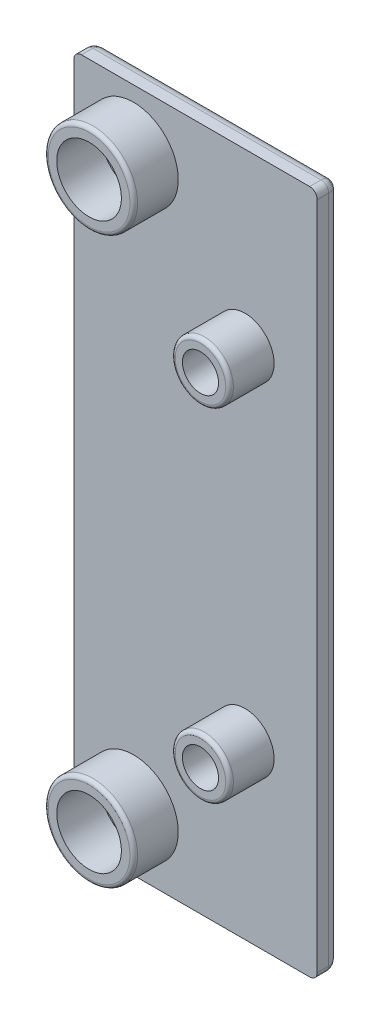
ISO-10303-21;
HEADER;
FILE_DESCRIPTION(('STEP AP214'),'2;1');
FILE_NAME('part.step','',(''),(''),'','','');
FILE_SCHEMA(('AUTOMOTIVE_DESIGN { 1 0 10303 214 1 1 1 1 }'));
ENDSEC;
DATA;
#1=APPLICATION_CONTEXT('core data for automotive mechanical design processes');
#2=APPLICATION_PROTOCOL_DEFINITION('international standard','automotive_design',2000,#1);
#3=PRODUCT_CONTEXT('',#1,'mechanical');
#4=PRODUCT('Part','Part','',(#3));
#5=PRODUCT_RELATED_PRODUCT_CATEGORY('part','',(#4));
#6=PRODUCT_DEFINITION_FORMATION('','',#4);
#7=PRODUCT_DEFINITION_CONTEXT('part definition',#1,'design');
#8=PRODUCT_DEFINITION('design','',#6,#7);
#9=PRODUCT_DEFINITION_SHAPE('','',#8);
#10=(LENGTH_UNIT() NAMED_UNIT(*) SI_UNIT(.MILLI.,.METRE.));
#11=(NAMED_UNIT(*) PLANE_ANGLE_UNIT() SI_UNIT($,.RADIAN.));
#12=(NAMED_UNIT(*) SI_UNIT($,.STERADIAN.) SOLID_ANGLE_UNIT());
#13=UNCERTAINTY_MEASURE_WITH_UNIT(LENGTH_MEASURE(1.E-05),#10,'distance_accuracy_value','');
#14=(GEOMETRIC_REPRESENTATION_CONTEXT(3) GLOBAL_UNCERTAINTY_ASSIGNED_CONTEXT((#13)) GLOBAL_UNIT_ASSIGNED_CONTEXT((#10,
#11,#12)) REPRESENTATION_CONTEXT('',''));
#15=CARTESIAN_POINT('',(0.,0.,0.));
#16=DIRECTION('',(0.,0.,1.));
#17=DIRECTION('',(1.,0.,0.));
#18=AXIS2_PLACEMENT_3D('',#15,#16,#17);
#19=CARTESIAN_POINT('',(-6.49999999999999,0.,3.));
#20=DIRECTION('',(0.,0.,1.));
#21=DIRECTION('',(1.,0.,0.));
#22=AXIS2_PLACEMENT_3D('',#19,#20,#21);
#23=PLANE('',#22);
#24=CARTESIAN_POINT('',(-14.65,-37.15,3.));
#25=DIRECTION('',(0.,0.,1.));
#26=DIRECTION('',(1.,0.,0.));
#27=AXIS2_PLACEMENT_3D('',#24,#25,#26);
#28=CIRCLE('',#27,4.25);
#29=CARTESIAN_POINT('',(-10.4,-37.15,3.));
#30=VERTEX_POINT('',#29);
#31=EDGE_CURVE('E19',#30,#30,#28,.T.);
#32=ORIENTED_EDGE('',*,*,#31,.T.);
#33=EDGE_LOOP('',(#32));
#34=FACE_BOUND('',#33,.T.);
#35=ADVANCED_FACE('F15',(#34),#23,.T.);
#36=CARTESIAN_POINT('',(-6.49999999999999,0.,3.));
#37=DIRECTION('',(0.,0.,1.));
#38=DIRECTION('',(1.,0.,0.));
#39=AXIS2_PLACEMENT_3D('',#36,#37,#38);
#40=PLANE('',#39);
#41=CARTESIAN_POINT('',(0.,-22.5,3.));
#42=DIRECTION('',(0.,0.,1.));
#43=DIRECTION('',(1.,0.,0.));
#44=AXIS2_PLACEMENT_3D('',#41,#42,#43);
#45=CIRCLE('',#44,2.375);
#46=CARTESIAN_POINT('',(2.375,-22.5,3.));
#47=VERTEX_POINT('',#46);
#48=EDGE_CURVE('E503',#47,#47,#45,.T.);
#49=ORIENTED_EDGE('',*,*,#48,.T.);
#50=EDGE_LOOP('',(#49));
#51=FACE_BOUND('',#50,.T.);
#52=ADVANCED_FACE('F234',(#51),#40,.T.);
#53=CARTESIAN_POINT('',(-6.49999999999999,0.,3.));
#54=DIRECTION('',(0.,0.,1.));
#55=DIRECTION('',(1.,0.,0.));
#56=AXIS2_PLACEMENT_3D('',#53,#54,#55);
#57=PLANE('',#56);
#58=CARTESIAN_POINT('',(-14.65,37.15,3.));
#59=DIRECTION('',(0.,0.,1.));
#60=DIRECTION('',(1.,0.,0.));
#61=AXIS2_PLACEMENT_3D('',#58,#59,#60);
#62=CIRCLE('',#61,4.25);
#63=CARTESIAN_POINT('',(-10.4,37.15,3.));
#64=VERTEX_POINT('',#63);
#65=EDGE_CURVE('E501',#64,#64,#62,.T.);
#66=ORIENTED_EDGE('',*,*,#65,.T.);
#67=EDGE_LOOP('',(#66));
#68=FACE_BOUND('',#67,.T.);
#69=ADVANCED_FACE('F230',(#68),#57,.T.);
#70=CARTESIAN_POINT('',(-6.49999999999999,0.,3.));
#71=DIRECTION('',(0.,0.,1.));
#72=DIRECTION('',(1.,0.,0.));
#73=AXIS2_PLACEMENT_3D('',#70,#71,#72);
#74=PLANE('',#73);
#75=CARTESIAN_POINT('',(0.,22.5,3.));
#76=DIRECTION('',(0.,0.,1.));
#77=DIRECTION('',(1.,0.,0.));
#78=AXIS2_PLACEMENT_3D('',#75,#76,#77);
#79=CIRCLE('',#78,2.375);
#80=CARTESIAN_POINT('',(2.375,22.5,3.));
#81=VERTEX_POINT('',#80);
#82=EDGE_CURVE('E107',#81,#81,#79,.T.);
#83=ORIENTED_EDGE('',*,*,#82,.T.);
#84=EDGE_LOOP('',(#83));
#85=FACE_BOUND('',#84,.T.);
#86=ADVANCED_FACE('F226',(#85),#74,.T.);
#87=CARTESIAN_POINT('',(-14.65,-37.15,3.));
#88=DIRECTION('',(0.,0.,1.));
#89=DIRECTION('',(1.,0.,0.));
#90=AXIS2_PLACEMENT_3D('',#87,#88,#89);
#91=CYLINDRICAL_SURFACE('',#90,4.25);
#92=ORIENTED_EDGE('',*,*,#31,.F.);
#93=EDGE_LOOP('',(#92));
#94=FACE_BOUND('',#93,.T.);
#95=CARTESIAN_POINT('',(-14.65,-37.15,8.85));
#96=DIRECTION('',(0.,0.,1.));
#97=DIRECTION('',(1.,0.,0.));
#98=AXIS2_PLACEMENT_3D('',#95,#96,#97);
#99=CIRCLE('',#98,4.25);
#100=CARTESIAN_POINT('',(-10.4,-37.15,8.85));
#101=VERTEX_POINT('',#100);
#102=EDGE_CURVE('E496',#101,#101,#99,.T.);
#103=ORIENTED_EDGE('',*,*,#102,.T.);
#104=EDGE_LOOP('',(#103));
#105=FACE_BOUND('',#104,.T.);
#106=ADVANCED_FACE('F229',(#94,#105),#91,.F.);
#107=CARTESIAN_POINT('',(0.,-22.5,3.));
#108=DIRECTION('',(0.,0.,1.));
#109=DIRECTION('',(1.,0.,0.));
#110=AXIS2_PLACEMENT_3D('',#107,#108,#109);
#111=CYLINDRICAL_SURFACE('',#110,2.375);
#112=ORIENTED_EDGE('',*,*,#48,.F.);
#113=EDGE_LOOP('',(#112));
#114=FACE_BOUND('',#113,.T.);
#115=CARTESIAN_POINT('',(0.,-22.5,8.85));
#116=DIRECTION('',(0.,0.,1.));
#117=DIRECTION('',(1.,0.,0.));
#118=AXIS2_PLACEMENT_3D('',#115,#116,#117);
#119=CIRCLE('',#118,2.375);
#120=CARTESIAN_POINT('',(2.375,-22.5,8.85));
#121=VERTEX_POINT('',#120);
#122=EDGE_CURVE('E493',#121,#121,#119,.T.);
#123=ORIENTED_EDGE('',*,*,#122,.T.);
#124=EDGE_LOOP('',(#123));
#125=FACE_BOUND('',#124,.T.);
#126=ADVANCED_FACE('F224',(#114,#125),#111,.F.);
#127=CARTESIAN_POINT('',(-14.65,37.15,3.));
#128=DIRECTION('',(0.,0.,1.));
#129=DIRECTION('',(1.,0.,0.));
#130=AXIS2_PLACEMENT_3D('',#127,#128,#129);
#131=CYLINDRICAL_SURFACE('',#130,4.25);
#132=ORIENTED_EDGE('',*,*,#65,.F.);
#133=EDGE_LOOP('',(#132));
#134=FACE_BOUND('',#133,.T.);
#135=CARTESIAN_POINT('',(-14.65,37.15,8.85));
#136=DIRECTION('',(0.,0.,1.));
#137=DIRECTION('',(1.,0.,0.));
#138=AXIS2_PLACEMENT_3D('',#135,#136,#137);
#139=CIRCLE('',#138,4.25);
#140=CARTESIAN_POINT('',(-10.4,37.15,8.85));
#141=VERTEX_POINT('',#140);
#142=EDGE_CURVE('E490',#141,#141,#139,.T.);
#143=ORIENTED_EDGE('',*,*,#142,.T.);
#144=EDGE_LOOP('',(#143));
#145=FACE_BOUND('',#144,.T.);
#146=ADVANCED_FACE('F220',(#134,#145),#131,.F.);
#147=CARTESIAN_POINT('',(0.,22.5,3.));
#148=DIRECTION('',(0.,0.,1.));
#149=DIRECTION('',(1.,0.,0.));
#150=AXIS2_PLACEMENT_3D('',#147,#148,#149);
#151=CYLINDRICAL_SURFACE('',#150,2.375);
#152=ORIENTED_EDGE('',*,*,#82,.F.);
#153=EDGE_LOOP('',(#152));
#154=FACE_BOUND('',#153,.T.);
#155=CARTESIAN_POINT('',(0.,22.5,8.85));
#156=DIRECTION('',(0.,0.,1.));
#157=DIRECTION('',(1.,0.,0.));
#158=AXIS2_PLACEMENT_3D('',#155,#156,#157);
#159=CIRCLE('',#158,2.375);
#160=CARTESIAN_POINT('',(2.375,22.5,8.85));
#161=VERTEX_POINT('',#160);
#162=EDGE_CURVE('E487',#161,#161,#159,.T.);
#163=ORIENTED_EDGE('',*,*,#162,.T.);
#164=EDGE_LOOP('',(#163));
#165=FACE_BOUND('',#164,.T.);
#166=ADVANCED_FACE('F217',(#154,#165),#151,.F.);
#167=CARTESIAN_POINT('',(8.50000000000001,-45.,1.5));
#168=CARTESIAN_POINT('',(8.64959965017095,-45.,1.5));
#169=CARTESIAN_POINT('',(8.8738193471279,-44.9486403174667,1.5));
#170=CARTESIAN_POINT('',(9.12870055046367,-44.7883228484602,1.5));
#171=CARTESIAN_POINT('',(9.31506284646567,-44.6021495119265,1.5));
#172=CARTESIAN_POINT('',(9.46187554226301,-44.3365630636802,1.5));
#173=CARTESIAN_POINT('',(9.5,-44.1121997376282,1.5));
#174=CARTESIAN_POINT('',(9.5,-44.,1.5));
#175=CARTESIAN_POINT('',(8.50000000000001,-45.,1.38780026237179));
#176=CARTESIAN_POINT('',(8.64959965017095,-45.,1.3765841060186));
#177=CARTESIAN_POINT('',(8.8738193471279,-44.9486403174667,1.36367785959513));
#178=CARTESIAN_POINT('',(9.12870055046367,-44.7883228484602,1.35659921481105));
#179=CARTESIAN_POINT('',(9.31506284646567,-44.6021495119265,1.3565890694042));
#180=CARTESIAN_POINT('',(9.46187554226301,-44.3365630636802,1.36547389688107));
#181=CARTESIAN_POINT('',(9.5,-44.1121997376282,1.37940644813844));
#182=CARTESIAN_POINT('',(9.5,-44.,1.38780026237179));
#183=CARTESIAN_POINT('',(8.49158722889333,-44.97476168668,1.16338280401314));
#184=CARTESIAN_POINT('',(8.6351552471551,-44.9692898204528,1.12990252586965));
#185=CARTESIAN_POINT('',(8.85034487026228,-44.9129544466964,1.09140384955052));
#186=CARTESIAN_POINT('',(9.09699708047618,-44.7531015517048,1.07030439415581));
#187=CARTESIAN_POINT('',(9.27923322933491,-44.5710258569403,1.07027325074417));
#188=CARTESIAN_POINT('',(9.42669208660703,-44.3145784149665,1.09675683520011));
#189=CARTESIAN_POINT('',(9.47064169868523,-44.0992596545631,1.13832011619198));
#190=CARTESIAN_POINT('',(9.47476168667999,-43.9915872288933,1.16338280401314));
#191=CARTESIAN_POINT('',(8.4542721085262,-44.8628163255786,0.84375167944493));
#192=CARTESIAN_POINT('',(8.57574375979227,-44.8396646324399,0.793175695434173));
#193=CARTESIAN_POINT('',(8.75789853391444,-44.7691124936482,0.735822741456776));
#194=CARTESIAN_POINT('',(8.97311307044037,-44.6144884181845,0.704556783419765));
#195=CARTESIAN_POINT('',(9.13813288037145,-44.4495739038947,0.704519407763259));
#196=CARTESIAN_POINT('',(9.28408190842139,-44.2275900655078,0.743733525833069));
#197=CARTESIAN_POINT('',(9.34549892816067,-44.0453903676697,0.805879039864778));
#198=CARTESIAN_POINT('',(9.36281632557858,-43.9542721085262,0.843751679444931));
#199=CARTESIAN_POINT('',(8.37425632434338,-44.6227689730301,0.46113831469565));
#200=CARTESIAN_POINT('',(8.45968943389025,-44.5786731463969,0.413719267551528));
#201=CARTESIAN_POINT('',(8.58787506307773,-44.4960567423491,0.361357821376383));
#202=CARTESIAN_POINT('',(8.7480588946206,-44.3602473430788,0.333111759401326));
#203=CARTESIAN_POINT('',(8.87898245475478,-44.2293617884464,0.333092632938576));
#204=CARTESIAN_POINT('',(9.01128114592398,-44.0665152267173,0.368466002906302));
#205=CARTESIAN_POINT('',(9.08977929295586,-43.938354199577,0.425600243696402));
#206=CARTESIAN_POINT('',(9.12276897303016,-43.8742563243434,0.461138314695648));
#207=CARTESIAN_POINT('',(8.22438291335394,-44.1731487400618,0.102452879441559));
#208=CARTESIAN_POINT('',(8.26692969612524,-44.1301693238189,0.088223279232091));
#209=CARTESIAN_POINT('',(8.33078679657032,-44.0658706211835,0.073213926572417));
#210=CARTESIAN_POINT('',(8.41610579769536,-43.9802000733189,0.065267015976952));
#211=CARTESIAN_POINT('',(8.4909000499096,-43.9054203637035,0.065268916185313));
#212=CARTESIAN_POINT('',(8.57660235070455,-43.8201401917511,0.075193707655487));
#213=CARTESIAN_POINT('',(8.64097886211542,-43.7563097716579,0.091771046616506));
#214=CARTESIAN_POINT('',(8.67314874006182,-43.7243829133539,0.102452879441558));
#215=CARTESIAN_POINT('',(8.07479982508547,-43.7243994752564,0.));
#216=CARTESIAN_POINT('',(8.08904741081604,-43.7101518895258,0.));
#217=CARTESIAN_POINT('',(8.11041878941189,-43.68878051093,0.));
#218=CARTESIAN_POINT('',(8.13891396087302,-43.6602853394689,0.));
#219=CARTESIAN_POINT('',(8.16384723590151,-43.6353520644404,0.));
#220=CARTESIAN_POINT('',(8.19234240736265,-43.6068568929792,0.));
#221=CARTESIAN_POINT('',(8.21371378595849,-43.5854855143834,0.));
#222=CARTESIAN_POINT('',(8.22439947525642,-43.5747998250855,0.));
#223=CARTESIAN_POINT('',(8.,-43.5,0.));
#224=CARTESIAN_POINT('',(8.,-43.5,0.));
#225=CARTESIAN_POINT('',(8.,-43.5,0.));
#226=CARTESIAN_POINT('',(8.00000000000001,-43.5,0.));
#227=CARTESIAN_POINT('',(8.,-43.5,0.));
#228=CARTESIAN_POINT('',(8.00000000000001,-43.5,0.));
#229=CARTESIAN_POINT('',(8.,-43.5,0.));
#230=CARTESIAN_POINT('',(8.,-43.5,0.));
#231=B_SPLINE_SURFACE_WITH_KNOTS('',3,3,((#167,#168,#169,#170,#171,#172,#173,#174),(#175,#176,
#177,#178,#179,#180,#181,#182),(#183,#184,#185,#186,#187,#188,#189,#190),(#191,#192,#193,#194,
#195,#196,#197,#198),(#199,#200,#201,#202,#203,#204,#205,#206),(#207,#208,#209,#210,#211,#212,
#213,#214),(#215,#216,#217,#218,#219,#220,#221,#222),(#223,#224,#225,#226,#227,#228,#229,#230)),
.UNSPECIFIED.,.F.,.F.,.F.,(4,1,1,1,1,4),(4,1,1,1,1,4),(0.,0.224399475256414,0.448798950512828,
0.673198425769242,1.12199737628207,1.5707963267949),(0.,0.285714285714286,0.428571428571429,
0.571428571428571,0.785714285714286,1.),.UNSPECIFIED.);
#232=CARTESIAN_POINT('',(8.,-43.5,0.));
#233=CARTESIAN_POINT('',(8.22439947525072,-43.5747998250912,0.));
#234=CARTESIAN_POINT('',(8.67314874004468,-43.7243829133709,0.102452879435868));
#235=CARTESIAN_POINT('',(9.12276897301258,-43.8742563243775,0.461138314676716));
#236=CARTESIAN_POINT('',(9.36281632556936,-43.9542721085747,0.843751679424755));
#237=CARTESIAN_POINT('',(9.4747616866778,-43.9915872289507,1.16338280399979));
#238=CARTESIAN_POINT('',(9.5,-44.0000000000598,1.38780026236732));
#239=CARTESIAN_POINT('',(9.5,-44.0000000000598,1.5));
#240=B_SPLINE_CURVE_WITH_KNOTS('',3,(#232,#233,#234,#235,#236,#237,#238,#239),.UNSPECIFIED.,.F.,
.F.,(4,1,1,1,1,4),(0.,0.448798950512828,0.897597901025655,1.12199737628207,1.34639685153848,
1.5707963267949),.UNSPECIFIED.);
#241=CARTESIAN_POINT('',(9.5,-44.00000000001,1.5));
#242=VERTEX_POINT('',#241);
#243=CARTESIAN_POINT('',(8.00000000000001,-43.5,0.));
#244=VERTEX_POINT('',#243);
#245=EDGE_CURVE('E111',#242,#244,#240,.F.);
#246=CARTESIAN_POINT('',(9.5,-44.,1.5));
#247=CARTESIAN_POINT('',(9.50000000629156,-44.0130898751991,1.5));
#248=CARTESIAN_POINT('',(9.49974054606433,-44.0261796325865,1.5));
#249=CARTESIAN_POINT('',(9.49870609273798,-44.0523387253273,1.5));
#250=CARTESIAN_POINT('',(9.49793110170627,-44.0654080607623,1.5));
#251=CARTESIAN_POINT('',(9.49586897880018,-44.0915063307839,1.5));
#252=CARTESIAN_POINT('',(9.49458184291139,-44.104535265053,1.5));
#253=CARTESIAN_POINT('',(9.49149881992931,-44.1305328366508,1.5));
#254=CARTESIAN_POINT('',(9.48970293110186,-44.1435014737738,1.5));
#255=CARTESIAN_POINT('',(9.48560577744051,-44.1693585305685,1.5));
#256=CARTESIAN_POINT('',(9.48330451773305,-44.1822469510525,1.5));
#257=CARTESIAN_POINT('',(9.47820000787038,-44.2079236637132,1.5));
#258=CARTESIAN_POINT('',(9.47539677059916,-44.220711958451,1.5));
#259=CARTESIAN_POINT('',(9.4692916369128,-44.2461684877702,1.5));
#260=CARTESIAN_POINT('',(9.46598975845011,-44.2588367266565,1.5));
#261=CARTESIAN_POINT('',(9.45889087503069,-44.284033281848,1.5));
#262=CARTESIAN_POINT('',(9.45509388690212,-44.2965616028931,1.5));
#263=CARTESIAN_POINT('',(9.44700758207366,-44.3214582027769,1.5));
#264=CARTESIAN_POINT('',(9.44271827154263,-44.3338264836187,1.5));
#265=CARTESIAN_POINT('',(9.43365345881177,-44.3583838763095,1.5));
#266=CARTESIAN_POINT('',(9.42887794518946,-44.3705729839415,1.5));
#267=CARTESIAN_POINT('',(9.41885130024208,-44.3947545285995,1.5));
#268=CARTESIAN_POINT('',(9.41360014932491,-44.4067469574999,1.5));
#269=CARTESIAN_POINT('',(9.40263191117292,-44.4305173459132,1.5));
#270=CARTESIAN_POINT('',(9.39691480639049,-44.4422952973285,1.5));
#271=CARTESIAN_POINT('',(9.38502456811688,-44.4656190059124,1.5));
#272=CARTESIAN_POINT('',(9.37885142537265,-44.4771647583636,1.5));
#273=CARTESIAN_POINT('',(9.36605894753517,-44.5000063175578,1.5));
#274=CARTESIAN_POINT('',(9.35943961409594,-44.511302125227,1.5));
#275=CARTESIAN_POINT('',(9.34576461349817,-44.5336260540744,1.5));
#276=CARTESIAN_POINT('',(9.33870895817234,-44.5446541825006,1.5));
#277=CARTESIAN_POINT('',(9.32417113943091,-44.566424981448,1.5));
#278=CARTESIAN_POINT('',(9.3166889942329,-44.5771676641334,1.5));
#279=CARTESIAN_POINT('',(9.30130813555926,-44.5983499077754,1.5));
#280=CARTESIAN_POINT('',(9.2934094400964,-44.608789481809,1.5));
#281=CARTESIAN_POINT('',(9.27720501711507,-44.6293474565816,1.5));
#282=CARTESIAN_POINT('',(9.26889929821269,-44.6394658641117,1.5));
#283=CARTESIAN_POINT('',(9.25189515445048,-44.6593673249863,1.5));
#284=CARTESIAN_POINT('',(9.24319672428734,-44.6691503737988,1.5));
#285=CARTESIAN_POINT('',(9.22542209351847,-44.6883676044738,1.5));
#286=CARTESIAN_POINT('',(9.21634588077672,-44.6978017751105,1.5));
#287=CARTESIAN_POINT('',(9.19783043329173,-44.7163075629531,1.5));
#288=CARTESIAN_POINT('',(9.18839118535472,-44.7253791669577,1.5));
#289=CARTESIAN_POINT('',(9.16916447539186,-44.7431461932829,1.5));
#290=CARTESIAN_POINT('',(9.15937700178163,-44.7518416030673,1.5));
#291=CARTESIAN_POINT('',(9.13946856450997,-44.7688425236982,1.5));
#292=CARTESIAN_POINT('',(9.12934759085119,-44.7771480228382,1.5));
#293=CARTESIAN_POINT('',(9.10878722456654,-44.7933556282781,1.5));
#294=CARTESIAN_POINT('',(9.09834782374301,-44.8012577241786,1.5));
#295=CARTESIAN_POINT('',(9.07716745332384,-44.8166469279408,1.5));
#296=CARTESIAN_POINT('',(9.06642648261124,-44.8241340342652,1.5));
#297=CARTESIAN_POINT('',(9.04465968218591,-44.8386814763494,1.5));
#298=CARTESIAN_POINT('',(9.03363385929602,-44.8457418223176,1.5));
#299=CARTESIAN_POINT('',(9.01131408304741,-44.8594239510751,1.5));
#300=CARTESIAN_POINT('',(9.00002014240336,-44.8660457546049,1.5));
#301=CARTESIAN_POINT('',(8.97718094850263,-44.8788391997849,1.5));
#302=CARTESIAN_POINT('',(8.96563571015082,-44.8850108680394,1.5));
#303=CARTESIAN_POINT('',(8.9423103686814,-44.8968916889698,1.5));
#304=CARTESIAN_POINT('',(8.930530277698,-44.9026008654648,1.5));
#305=CARTESIAN_POINT('',(8.90675324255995,-44.9135477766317,1.5));
#306=CARTESIAN_POINT('',(8.89475630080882,-44.9187855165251,1.5));
#307=CARTESIAN_POINT('',(8.87056545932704,-44.9287854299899,1.5));
#308=CARTESIAN_POINT('',(8.85837155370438,-44.9335475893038,1.5));
#309=CARTESIAN_POINT('',(8.83380620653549,-44.9425913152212,1.5));
#310=CARTESIAN_POINT('',(8.82143475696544,-44.9468728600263,1.5));
#311=CARTESIAN_POINT('',(8.79653385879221,-44.9549505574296,1.5));
#312=CARTESIAN_POINT('',(8.78400440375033,-44.9587466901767,1.5));
#313=CARTESIAN_POINT('',(8.75880699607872,-44.9658486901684,1.5));
#314=CARTESIAN_POINT('',(8.74613904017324,-44.9691545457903,1.5));
#315=CARTESIAN_POINT('',(8.72068413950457,-44.9752711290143,1.5));
#316=CARTESIAN_POINT('',(8.70789719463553,-44.978081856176,1.5));
#317=CARTESIAN_POINT('',(8.68222382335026,-44.9832033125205,1.5));
#318=CARTESIAN_POINT('',(8.66933739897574,-44.985514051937,1.5));
#319=CARTESIAN_POINT('',(8.64348457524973,-44.9896306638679,1.5));
#320=CARTESIAN_POINT('',(8.63051817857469,-44.9914365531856,1.5));
#321=CARTESIAN_POINT('',(8.60452492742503,-44.9945386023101,1.5));
#322=CARTESIAN_POINT('',(8.5914980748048,-44.9958347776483,1.5));
#323=CARTESIAN_POINT('',(8.56540339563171,-44.9979125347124,1.5));
#324=CARTESIAN_POINT('',(8.55233556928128,-44.9986941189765,1.5));
#325=CARTESIAN_POINT('',(8.52617855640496,-44.9997378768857,1.5));
#326=CARTESIAN_POINT('',(8.51308936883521,-45.0000000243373,1.5));
#327=CARTESIAN_POINT('',(8.50000000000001,-45.,1.5));
#328=B_SPLINE_CURVE_WITH_KNOTS('',3,(#246,#247,#248,#249,#250,#251,#252,#253,#254,#255,#256,
#257,#258,#259,#260,#261,#262,#263,#264,#265,#266,#267,#268,#269,#270,#271,#272,#273,#274,#275,
#276,#277,#278,#279,#280,#281,#282,#283,#284,#285,#286,#287,#288,#289,#290,#291,#292,#293,#294,
#295,#296,#297,#298,#299,#300,#301,#302,#303,#304,#305,#306,#307,#308,#309,#310,#311,#312,#313,
#314,#315,#316,#317,#318,#319,#320,#321,#322,#323,#324,#325,#326,#327),.UNSPECIFIED.,.F.,.F.,(4,
2,2,2,2,2,2,2,2,2,2,2,2,2,2,2,2,2,2,2,2,2,2,2,2,2,2,2,2,2,2,2,2,2,2,2,2,2,2,2,4),(0.,
0.0392668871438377,0.0785336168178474,0.117800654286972,0.157067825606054,0.19633459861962,
0.235600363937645,0.274864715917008,0.31412773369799,0.353390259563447,0.39265370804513,
0.43191877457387,0.471185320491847,0.510452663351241,0.549719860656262,0.588985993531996,
0.628250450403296,0.667513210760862,0.706775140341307,0.746037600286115,0.785301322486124,
0.824566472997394,0.863832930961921,0.903100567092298,0.942369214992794,0.981638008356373,
1.02090586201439,1.06017185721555,1.09943552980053,1.13869717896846,1.17795839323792,
1.21722078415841,1.25648495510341,1.29575073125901,1.33501743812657,1.37428417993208,
1.41355011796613,1.45281474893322,1.49207818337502,1.53134142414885,1.57060664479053),.UNSPECIFIED.);
#329=CARTESIAN_POINT('',(8.50000000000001,-45.,1.5));
#330=VERTEX_POINT('',#329);
#331=EDGE_CURVE('E93',#242,#330,#328,.T.);
#332=CARTESIAN_POINT('',(8.50000000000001,-45.,1.5));
#333=CARTESIAN_POINT('',(8.50000000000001,-45.,1.38780026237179));
#334=CARTESIAN_POINT('',(8.49158722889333,-44.9747616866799,1.16338280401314));
#335=CARTESIAN_POINT('',(8.4542721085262,-44.8628163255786,0.843751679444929));
#336=CARTESIAN_POINT('',(8.37425632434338,-44.6227689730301,0.461138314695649));
#337=CARTESIAN_POINT('',(8.22438291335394,-44.1731487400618,0.102452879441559));
#338=CARTESIAN_POINT('',(8.07479982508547,-43.7243994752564,0.));
#339=CARTESIAN_POINT('',(8.,-43.5,0.));
#340=B_SPLINE_CURVE_WITH_KNOTS('',3,(#332,#333,#334,#335,#336,#337,#338,#339),.UNSPECIFIED.,.F.,
.F.,(4,1,1,1,1,4),(0.,0.224399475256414,0.448798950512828,0.673198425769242,1.12199737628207,
1.5707963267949),.UNSPECIFIED.);
#341=EDGE_CURVE('E116',#244,#330,#340,.F.);
#342=ORIENTED_EDGE('',*,*,#245,.F.);
#343=ORIENTED_EDGE('',*,*,#331,.T.);
#344=ORIENTED_EDGE('',*,*,#341,.F.);
#345=EDGE_LOOP('',(#342,#343,#344));
#346=FACE_BOUND('',#345,.T.);
#347=ADVANCED_FACE('F114',(#346),#231,.T.);
#348=CARTESIAN_POINT('',(9.5,44.,1.5));
#349=CARTESIAN_POINT('',(9.5,44.1495996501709,1.5));
#350=CARTESIAN_POINT('',(9.44864031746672,44.3738193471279,1.5));
#351=CARTESIAN_POINT('',(9.28832284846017,44.6287005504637,1.5));
#352=CARTESIAN_POINT('',(9.10214951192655,44.8150628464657,1.5));
#353=CARTESIAN_POINT('',(8.83656306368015,44.961875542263,1.5));
#354=CARTESIAN_POINT('',(8.6121997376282,45.,1.5));
#355=CARTESIAN_POINT('',(8.49999999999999,45.,1.5));
#356=CARTESIAN_POINT('',(9.5,44.,1.38780026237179));
#357=CARTESIAN_POINT('',(9.5,44.1495996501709,1.3765841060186));
#358=CARTESIAN_POINT('',(9.44864031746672,44.3738193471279,1.36367785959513));
#359=CARTESIAN_POINT('',(9.28832284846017,44.6287005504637,1.35659921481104));
#360=CARTESIAN_POINT('',(9.10214951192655,44.8150628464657,1.3565890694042));
#361=CARTESIAN_POINT('',(8.83656306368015,44.961875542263,1.36547389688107));
#362=CARTESIAN_POINT('',(8.6121997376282,45.,1.37940644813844));
#363=CARTESIAN_POINT('',(8.49999999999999,45.,1.38780026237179));
#364=CARTESIAN_POINT('',(9.47476168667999,43.9915872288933,1.16338280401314));
#365=CARTESIAN_POINT('',(9.46928982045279,44.1351552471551,1.12990252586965));
#366=CARTESIAN_POINT('',(9.41295444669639,44.3503448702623,1.09140384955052));
#367=CARTESIAN_POINT('',(9.25310155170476,44.5969970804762,1.07030439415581));
#368=CARTESIAN_POINT('',(9.07102585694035,44.7792332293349,1.07027325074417));
#369=CARTESIAN_POINT('',(8.81457841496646,44.926692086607,1.09675683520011));
#370=CARTESIAN_POINT('',(8.5992596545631,44.9706416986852,1.13832011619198));
#371=CARTESIAN_POINT('',(8.49158722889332,44.97476168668,1.16338280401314));
#372=CARTESIAN_POINT('',(9.36281632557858,43.9542721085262,0.843751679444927));
#373=CARTESIAN_POINT('',(9.33966463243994,44.0757437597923,0.79317569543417));
#374=CARTESIAN_POINT('',(9.26911249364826,44.2578985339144,0.735822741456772));
#375=CARTESIAN_POINT('',(9.11448841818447,44.4731130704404,0.704556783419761));
#376=CARTESIAN_POINT('',(8.94957390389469,44.6381328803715,0.704519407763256));
#377=CARTESIAN_POINT('',(8.72759006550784,44.7840819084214,0.743733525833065));
#378=CARTESIAN_POINT('',(8.54539036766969,44.8454989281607,0.805879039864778));
#379=CARTESIAN_POINT('',(8.45427210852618,44.8628163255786,0.84375167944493));
#380=CARTESIAN_POINT('',(9.12276897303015,43.8742563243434,0.461138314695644));
#381=CARTESIAN_POINT('',(9.07867314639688,43.9596894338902,0.413719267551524));
#382=CARTESIAN_POINT('',(8.99605674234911,44.0878750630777,0.361357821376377));
#383=CARTESIAN_POINT('',(8.86024734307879,44.2480588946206,0.333111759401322));
#384=CARTESIAN_POINT('',(8.72936178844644,44.3789824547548,0.333092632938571));
#385=CARTESIAN_POINT('',(8.56651522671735,44.511281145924,0.368466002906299));
#386=CARTESIAN_POINT('',(8.43835419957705,44.5897792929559,0.425600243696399));
#387=CARTESIAN_POINT('',(8.37425632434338,44.6227689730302,0.461138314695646));
#388=CARTESIAN_POINT('',(8.67314874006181,43.7243829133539,0.102452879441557));
#389=CARTESIAN_POINT('',(8.6301693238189,43.7669296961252,0.088223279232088));
#390=CARTESIAN_POINT('',(8.56587062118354,43.8307867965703,0.073213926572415));
#391=CARTESIAN_POINT('',(8.48020007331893,43.9161057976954,0.065267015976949));
#392=CARTESIAN_POINT('',(8.40542036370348,43.9909000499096,0.065268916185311));
#393=CARTESIAN_POINT('',(8.32014019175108,44.0766023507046,0.075193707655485));
#394=CARTESIAN_POINT('',(8.25630977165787,44.1409788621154,0.091771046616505));
#395=CARTESIAN_POINT('',(8.22438291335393,44.1731487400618,0.102452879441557));
#396=CARTESIAN_POINT('',(8.22439947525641,43.5747998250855,0.));
#397=CARTESIAN_POINT('',(8.21015188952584,43.589047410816,0.));
#398=CARTESIAN_POINT('',(8.18878051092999,43.6104187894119,0.));
#399=CARTESIAN_POINT('',(8.16028533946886,43.638913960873,0.));
#400=CARTESIAN_POINT('',(8.13535206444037,43.6638472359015,0.));
#401=CARTESIAN_POINT('',(8.10685689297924,43.6923424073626,0.));
#402=CARTESIAN_POINT('',(8.08548551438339,43.7137137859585,0.));
#403=CARTESIAN_POINT('',(8.07479982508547,43.7243994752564,0.));
#404=CARTESIAN_POINT('',(8.,43.5,0.));
#405=CARTESIAN_POINT('',(8.,43.5,0.));
#406=CARTESIAN_POINT('',(7.99999999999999,43.5,0.));
#407=CARTESIAN_POINT('',(8.,43.5,0.));
#408=CARTESIAN_POINT('',(7.99999999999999,43.5,0.));
#409=CARTESIAN_POINT('',(8.,43.5,0.));
#410=CARTESIAN_POINT('',(8.,43.5,0.));
#411=CARTESIAN_POINT('',(8.,43.5,0.));
#412=B_SPLINE_SURFACE_WITH_KNOTS('',3,3,((#348,#349,#350,#351,#352,#353,#354,#355),(#356,#357,
#358,#359,#360,#361,#362,#363),(#364,#365,#366,#367,#368,#369,#370,#371),(#372,#373,#374,#375,
#376,#377,#378,#379),(#380,#381,#382,#383,#384,#385,#386,#387),(#388,#389,#390,#391,#392,#393,
#394,#395),(#396,#397,#398,#399,#400,#401,#402,#403),(#404,#405,#406,#407,#408,#409,#410,#411)),
.UNSPECIFIED.,.F.,.F.,.F.,(4,1,1,1,1,4),(4,1,1,1,1,4),(0.,0.224399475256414,0.448798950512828,
0.673198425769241,1.12199737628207,1.5707963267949),(0.,0.285714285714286,0.428571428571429,
0.571428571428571,0.785714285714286,1.),.UNSPECIFIED.);
#413=CARTESIAN_POINT('',(8.,43.5,0.));
#414=CARTESIAN_POINT('',(8.0747998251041,43.7243994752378,0.));
#415=CARTESIAN_POINT('',(8.2243829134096,44.1731487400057,0.10245287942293));
#416=CARTESIAN_POINT('',(8.37425632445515,44.6227689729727,0.461138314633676));
#417=CARTESIAN_POINT('',(8.45427210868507,44.8628163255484,0.843751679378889));
#418=CARTESIAN_POINT('',(8.49158722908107,44.9747616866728,1.16338280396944));
#419=CARTESIAN_POINT('',(8.50000000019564,45.,1.38780026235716));
#420=CARTESIAN_POINT('',(8.50000000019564,45.,1.5));
#421=B_SPLINE_CURVE_WITH_KNOTS('',3,(#413,#414,#415,#416,#417,#418,#419,#420),.UNSPECIFIED.,.F.,
.F.,(4,1,1,1,1,4),(0.,0.448798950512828,0.897597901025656,1.12199737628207,1.34639685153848,
1.5707963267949),.UNSPECIFIED.);
#422=CARTESIAN_POINT('',(8.5000000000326,45.,1.5));
#423=VERTEX_POINT('',#422);
#424=CARTESIAN_POINT('',(8.,43.5,0.));
#425=VERTEX_POINT('',#424);
#426=EDGE_CURVE('E403',#423,#425,#421,.F.);
#427=CARTESIAN_POINT('',(8.49999999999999,45.,1.5));
#428=CARTESIAN_POINT('',(8.51308987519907,45.0000000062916,1.5));
#429=CARTESIAN_POINT('',(8.52617963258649,44.9997405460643,1.5));
#430=CARTESIAN_POINT('',(8.55233872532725,44.998706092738,1.5));
#431=CARTESIAN_POINT('',(8.56540806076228,44.9979311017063,1.5));
#432=CARTESIAN_POINT('',(8.59150633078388,44.9958689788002,1.5));
#433=CARTESIAN_POINT('',(8.60453526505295,44.9945818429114,1.5));
#434=CARTESIAN_POINT('',(8.63053283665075,44.9914988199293,1.5));
#435=CARTESIAN_POINT('',(8.64350147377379,44.9897029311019,1.5));
#436=CARTESIAN_POINT('',(8.66935853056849,44.9856057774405,1.5));
#437=CARTESIAN_POINT('',(8.68224695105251,44.9833045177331,1.5));
#438=CARTESIAN_POINT('',(8.70792366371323,44.9782000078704,1.5));
#439=CARTESIAN_POINT('',(8.72071195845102,44.9753967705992,1.5));
#440=CARTESIAN_POINT('',(8.74616848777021,44.9692916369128,1.5));
#441=CARTESIAN_POINT('',(8.75883672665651,44.9659897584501,1.5));
#442=CARTESIAN_POINT('',(8.78403328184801,44.9588908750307,1.5));
#443=CARTESIAN_POINT('',(8.79656160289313,44.9550938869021,1.5));
#444=CARTESIAN_POINT('',(8.82145820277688,44.9470075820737,1.5));
#445=CARTESIAN_POINT('',(8.83382648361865,44.9427182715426,1.5));
#446=CARTESIAN_POINT('',(8.85838387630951,44.9336534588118,1.5));
#447=CARTESIAN_POINT('',(8.87057298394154,44.9288779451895,1.5));
#448=CARTESIAN_POINT('',(8.89475452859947,44.9188513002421,1.5));
#449=CARTESIAN_POINT('',(8.90674695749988,44.9136001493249,1.5));
#450=CARTESIAN_POINT('',(8.93051734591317,44.9026319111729,1.5));
#451=CARTESIAN_POINT('',(8.94229529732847,44.8969148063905,1.5));
#452=CARTESIAN_POINT('',(8.9656190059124,44.8850245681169,1.5));
#453=CARTESIAN_POINT('',(8.97716475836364,44.8788514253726,1.5));
#454=CARTESIAN_POINT('',(9.00000631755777,44.8660589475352,1.5));
#455=CARTESIAN_POINT('',(9.01130212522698,44.8594396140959,1.5));
#456=CARTESIAN_POINT('',(9.03362605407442,44.8457646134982,1.5));
#457=CARTESIAN_POINT('',(9.0446541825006,44.8387089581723,1.5));
#458=CARTESIAN_POINT('',(9.06642498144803,44.8241711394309,1.5));
#459=CARTESIAN_POINT('',(9.07716766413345,44.8166889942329,1.5));
#460=CARTESIAN_POINT('',(9.09834990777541,44.8013081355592,1.5));
#461=CARTESIAN_POINT('',(9.108789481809,44.7934094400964,1.5));
#462=CARTESIAN_POINT('',(9.12934745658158,44.7772050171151,1.5));
#463=CARTESIAN_POINT('',(9.13946586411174,44.7688992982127,1.5));
#464=CARTESIAN_POINT('',(9.15936732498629,44.7518951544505,1.5));
#465=CARTESIAN_POINT('',(9.16915037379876,44.7431967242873,1.5));
#466=CARTESIAN_POINT('',(9.18836760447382,44.7254220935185,1.5));
#467=CARTESIAN_POINT('',(9.19780177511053,44.7163458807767,1.5));
#468=CARTESIAN_POINT('',(9.21630756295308,44.6978304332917,1.5));
#469=CARTESIAN_POINT('',(9.22537916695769,44.6883911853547,1.5));
#470=CARTESIAN_POINT('',(9.24314619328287,44.6691644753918,1.5));
#471=CARTESIAN_POINT('',(9.25184160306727,44.6593770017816,1.5));
#472=CARTESIAN_POINT('',(9.2688425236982,44.63946856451,1.5));
#473=CARTESIAN_POINT('',(9.27714802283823,44.6293475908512,1.5));
#474=CARTESIAN_POINT('',(9.29335562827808,44.6087872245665,1.5));
#475=CARTESIAN_POINT('',(9.30125772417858,44.598347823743,1.5));
#476=CARTESIAN_POINT('',(9.31664692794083,44.5771674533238,1.5));
#477=CARTESIAN_POINT('',(9.32413403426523,44.5664264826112,1.5));
#478=CARTESIAN_POINT('',(9.33868147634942,44.5446596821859,1.5));
#479=CARTESIAN_POINT('',(9.34574182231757,44.533633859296,1.5));
#480=CARTESIAN_POINT('',(9.35942395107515,44.5113140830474,1.5));
#481=CARTESIAN_POINT('',(9.36604575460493,44.5000201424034,1.5));
#482=CARTESIAN_POINT('',(9.37883919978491,44.4771809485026,1.5));
#483=CARTESIAN_POINT('',(9.38501086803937,44.4656357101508,1.5));
#484=CARTESIAN_POINT('',(9.39689168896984,44.4423103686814,1.5));
#485=CARTESIAN_POINT('',(9.40260086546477,44.430530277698,1.5));
#486=CARTESIAN_POINT('',(9.4135477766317,44.40675324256,1.5));
#487=CARTESIAN_POINT('',(9.41878551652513,44.3947563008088,1.5));
#488=CARTESIAN_POINT('',(9.42878542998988,44.370565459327,1.5));
#489=CARTESIAN_POINT('',(9.43354758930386,44.3583715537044,1.5));
#490=CARTESIAN_POINT('',(9.44259131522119,44.3338062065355,1.5));
#491=CARTESIAN_POINT('',(9.4468728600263,44.3214347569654,1.5));
#492=CARTESIAN_POINT('',(9.4549505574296,44.2965338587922,1.5));
#493=CARTESIAN_POINT('',(9.45874669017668,44.2840044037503,1.5));
#494=CARTESIAN_POINT('',(9.46584869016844,44.2588069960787,1.5));
#495=CARTESIAN_POINT('',(9.46915454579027,44.2461390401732,1.5));
#496=CARTESIAN_POINT('',(9.47527112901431,44.2206841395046,1.5));
#497=CARTESIAN_POINT('',(9.47808185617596,44.2078971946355,1.5));
#498=CARTESIAN_POINT('',(9.48320331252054,44.1822238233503,1.5));
#499=CARTESIAN_POINT('',(9.48551405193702,44.1693373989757,1.5));
#500=CARTESIAN_POINT('',(9.48963066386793,44.1434845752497,1.5));
#501=CARTESIAN_POINT('',(9.4914365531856,44.1305181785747,1.5));
#502=CARTESIAN_POINT('',(9.49453860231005,44.104524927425,1.5));
#503=CARTESIAN_POINT('',(9.49583477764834,44.0914980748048,1.5));
#504=CARTESIAN_POINT('',(9.49791253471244,44.0654033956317,1.5));
#505=CARTESIAN_POINT('',(9.49869411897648,44.0523355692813,1.5));
#506=CARTESIAN_POINT('',(9.49973787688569,44.026178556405,1.5));
#507=CARTESIAN_POINT('',(9.50000002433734,44.0130893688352,1.5));
#508=CARTESIAN_POINT('',(9.5,44.,1.5));
#509=B_SPLINE_CURVE_WITH_KNOTS('',3,(#427,#428,#429,#430,#431,#432,#433,#434,#435,#436,#437,
#438,#439,#440,#441,#442,#443,#444,#445,#446,#447,#448,#449,#450,#451,#452,#453,#454,#455,#456,
#457,#458,#459,#460,#461,#462,#463,#464,#465,#466,#467,#468,#469,#470,#471,#472,#473,#474,#475,
#476,#477,#478,#479,#480,#481,#482,#483,#484,#485,#486,#487,#488,#489,#490,#491,#492,#493,#494,
#495,#496,#497,#498,#499,#500,#501,#502,#503,#504,#505,#506,#507,#508),.UNSPECIFIED.,.F.,.F.,(4,
2,2,2,2,2,2,2,2,2,2,2,2,2,2,2,2,2,2,2,2,2,2,2,2,2,2,2,2,2,2,2,2,2,2,2,2,2,2,2,4),(0.,
0.0392668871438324,0.0785336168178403,0.117800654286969,0.15706782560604,0.196334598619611,
0.235600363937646,0.274864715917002,0.314127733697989,0.353390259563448,0.39265370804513,
0.431918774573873,0.471185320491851,0.510452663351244,0.549719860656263,0.588985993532,
0.628250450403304,0.667513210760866,0.706775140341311,0.746037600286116,0.785301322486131,
0.824566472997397,0.863832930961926,0.903100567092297,0.942369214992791,0.981638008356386,
1.0209058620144,1.06017185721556,1.09943552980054,1.13869717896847,1.17795839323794,
1.21722078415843,1.25648495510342,1.29575073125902,1.33501743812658,1.37428417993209,
1.41355011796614,1.45281474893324,1.49207818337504,1.53134142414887,1.57060664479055),.UNSPECIFIED.);
#510=CARTESIAN_POINT('',(9.5,44.,1.5));
#511=VERTEX_POINT('',#510);
#512=EDGE_CURVE('E106',#423,#511,#509,.T.);
#513=CARTESIAN_POINT('',(9.5,44.,1.5));
#514=CARTESIAN_POINT('',(9.50000008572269,44.0000000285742,1.48036416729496));
#515=CARTESIAN_POINT('',(9.49961350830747,43.9998711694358,1.46072845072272));
#516=CARTESIAN_POINT('',(9.4980704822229,43.9993568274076,1.42148691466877));
#517=CARTESIAN_POINT('',(9.49691388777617,43.9989712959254,1.40188110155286));
#518=CARTESIAN_POINT('',(9.49383376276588,43.9979445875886,1.36272985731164));
#519=CARTESIAN_POINT('',(9.49190997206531,43.9973033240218,1.34318444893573));
#520=CARTESIAN_POINT('',(9.48729846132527,43.9957661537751,1.30418441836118));
#521=CARTESIAN_POINT('',(9.4846103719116,43.9948701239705,1.28472984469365));
#522=CARTESIAN_POINT('',(9.47847339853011,43.9928244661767,1.24594186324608));
#523=CARTESIAN_POINT('',(9.47502403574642,43.9916746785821,1.22660853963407));
#524=CARTESIAN_POINT('',(9.46736703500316,43.989122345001,1.18809356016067));
#525=CARTESIAN_POINT('',(9.46315880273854,43.9877196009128,1.16891203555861));
#526=CARTESIAN_POINT('',(9.45398908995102,43.9846630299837,1.13073052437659));
#527=CARTESIAN_POINT('',(9.44902688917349,43.9830089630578,1.11173073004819));
#528=CARTESIAN_POINT('',(9.43836090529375,43.9794536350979,1.07394045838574));
#529=CARTESIAN_POINT('',(9.43265628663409,43.9775520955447,1.05515024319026));
#530=CARTESIAN_POINT('',(9.42051607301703,43.9735053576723,1.01780707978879));
#531=CARTESIAN_POINT('',(9.41407954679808,43.9713598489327,0.999254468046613));
#532=CARTESIAN_POINT('',(9.40048634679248,43.9668287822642,0.962414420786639));
#533=CARTESIAN_POINT('',(9.39332866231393,43.964442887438,0.944127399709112));
#534=CARTESIAN_POINT('',(9.37830401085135,43.9594346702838,0.907846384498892));
#535=CARTESIAN_POINT('',(9.37043596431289,43.9568119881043,0.889852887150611));
#536=CARTESIAN_POINT('',(9.3540010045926,43.9513336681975,0.854187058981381));
#537=CARTESIAN_POINT('',(9.34543294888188,43.9484776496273,0.836515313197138));
#538=CARTESIAN_POINT('',(9.32761112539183,43.9425370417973,0.801520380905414));
#539=CARTESIAN_POINT('',(9.31835618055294,43.9394520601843,0.784197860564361));
#540=CARTESIAN_POINT('',(9.29917566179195,43.9330585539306,0.749928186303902));
#541=CARTESIAN_POINT('',(9.28924890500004,43.929749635,0.732981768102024));
#542=CARTESIAN_POINT('',(9.26873944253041,43.9229131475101,0.699491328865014));
#543=CARTESIAN_POINT('',(9.25815555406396,43.919385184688,0.68294811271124));
#544=CARTESIAN_POINT('',(9.23634656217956,43.9121155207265,0.65029110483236));
#545=CARTESIAN_POINT('',(9.22512027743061,43.9083734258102,0.634178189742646));
#546=CARTESIAN_POINT('',(9.2020413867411,43.900680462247,0.602408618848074));
#547=CARTESIAN_POINT('',(9.19018759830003,43.8967291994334,0.586752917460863));
#548=CARTESIAN_POINT('',(9.16586789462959,43.8886226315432,0.555925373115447));
#549=CARTESIAN_POINT('',(9.15340078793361,43.8844669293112,0.540754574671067));
#550=CARTESIAN_POINT('',(9.12787719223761,43.8759590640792,0.510916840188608));
#551=CARTESIAN_POINT('',(9.11481952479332,43.8716065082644,0.496251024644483));
#552=CARTESIAN_POINT('',(9.0881386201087,43.8627128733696,0.46744198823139));
#553=CARTESIAN_POINT('',(9.07451424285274,43.8581714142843,0.453299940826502));
#554=CARTESIAN_POINT('',(9.04672340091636,43.8489078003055,0.425557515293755));
#555=CARTESIAN_POINT('',(9.0325558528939,43.844185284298,0.41195834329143));
#556=CARTESIAN_POINT('',(9.00370221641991,43.8345674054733,0.385320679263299));
#557=CARTESIAN_POINT('',(8.98901511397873,43.8296717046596,0.372283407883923));
#558=CARTESIAN_POINT('',(8.95914588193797,43.8197152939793,0.346788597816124));
#559=CARTESIAN_POINT('',(8.94396281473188,43.8146542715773,0.334332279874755));
#560=CARTESIAN_POINT('',(8.91312516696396,43.8043750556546,0.310018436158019));
#561=CARTESIAN_POINT('',(8.89746972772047,43.7991565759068,0.29816212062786));
#562=CARTESIAN_POINT('',(8.86571084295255,43.7885702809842,0.275067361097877));
#563=CARTESIAN_POINT('',(8.84960661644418,43.7832022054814,0.263830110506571));
#564=CARTESIAN_POINT('',(8.81697367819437,43.7723245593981,0.241992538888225));
#565=CARTESIAN_POINT('',(8.80044425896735,43.7668147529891,0.231393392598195));
#566=CARTESIAN_POINT('',(8.76698441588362,43.7556614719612,0.210851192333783));
#567=CARTESIAN_POINT('',(8.75005335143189,43.7500177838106,0.200909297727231));
#568=CARTESIAN_POINT('',(8.71581387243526,43.7386046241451,0.181700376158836));
#569=CARTESIAN_POINT('',(8.69850487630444,43.7328349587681,0.172434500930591));
#570=CARTESIAN_POINT('',(8.6635325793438,43.7211775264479,0.154597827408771));
#571=CARTESIAN_POINT('',(8.64586874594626,43.7152895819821,0.146028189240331));
#572=CARTESIAN_POINT('',(8.61021312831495,43.703404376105,0.129598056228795));
#573=CARTESIAN_POINT('',(8.59222086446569,43.6974069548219,0.121738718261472));
#574=CARTESIAN_POINT('',(8.55593868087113,43.6853128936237,0.106734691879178));
#575=CARTESIAN_POINT('',(8.53764835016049,43.6792161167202,0.0995911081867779));
#576=CARTESIAN_POINT('',(8.50079957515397,43.666933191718,0.0860258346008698));
#577=CARTESIAN_POINT('',(8.48224079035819,43.6607469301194,0.0796051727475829));
#578=CARTESIAN_POINT('',(8.44488485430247,43.6482949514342,0.0674925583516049));
#579=CARTESIAN_POINT('',(8.42608743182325,43.6420291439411,0.0618015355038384));
#580=CARTESIAN_POINT('',(8.38828391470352,43.6294279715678,0.0511551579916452));
#581=CARTESIAN_POINT('',(8.36927761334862,43.6230925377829,0.0462006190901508));
#582=CARTESIAN_POINT('',(8.33108605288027,43.6103620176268,0.0370341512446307));
#583=CARTESIAN_POINT('',(8.31190064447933,43.6039668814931,0.032822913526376));
#584=CARTESIAN_POINT('',(8.273380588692,43.5911268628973,0.0251500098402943));
#585=CARTESIAN_POINT('',(8.25404584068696,43.5846819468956,0.0216889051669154));
#586=CARTESIAN_POINT('',(8.21525683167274,43.5717522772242,0.0155232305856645));
#587=CARTESIAN_POINT('',(8.19580250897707,43.5652675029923,0.0128190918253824));
#588=CARTESIAN_POINT('',(8.1568040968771,43.5522680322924,0.00817432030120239));
#589=CARTESIAN_POINT('',(8.1372599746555,43.5457533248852,0.00623399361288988));
#590=CARTESIAN_POINT('',(8.09811167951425,43.5327038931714,0.00312378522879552));
#591=CARTESIAN_POINT('',(8.07850749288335,43.5261691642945,0.0019540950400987));
#592=CARTESIAN_POINT('',(8.03926894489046,43.5130896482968,0.000392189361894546));
#593=CARTESIAN_POINT('',(8.01963458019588,43.5065448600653,6.70009819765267E-08));
#594=CARTESIAN_POINT('',(8.,43.5,0.));
#595=B_SPLINE_CURVE_WITH_KNOTS('',3,(#513,#514,#515,#516,#517,#518,#519,#520,#521,#522,#523,
#524,#525,#526,#527,#528,#529,#530,#531,#532,#533,#534,#535,#536,#537,#538,#539,#540,#541,#542,
#543,#544,#545,#546,#547,#548,#549,#550,#551,#552,#553,#554,#555,#556,#557,#558,#559,#560,#561,
#562,#563,#564,#565,#566,#567,#568,#569,#570,#571,#572,#573,#574,#575,#576,#577,#578,#579,#580,
#581,#582,#583,#584,#585,#586,#587,#588,#589,#590,#591,#592,#593,#594),.UNSPECIFIED.,.F.,.F.,(4,
2,2,2,2,2,2,2,2,2,2,2,2,2,2,2,2,2,2,2,2,2,2,2,2,2,2,2,2,2,2,2,2,2,2,2,2,2,2,2,4),(0.,
0.0589031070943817,0.11781736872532,0.17675162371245,0.235714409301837,0.294714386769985,
0.353760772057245,0.412863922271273,0.472034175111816,0.531280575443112,0.590611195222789,
0.65003354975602,0.709554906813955,0.769180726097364,0.82891440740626,0.888758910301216,
0.94871724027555,1.00879288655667,1.06899024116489,1.12931353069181,1.18976466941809,
1.25034338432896,1.31104767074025,1.37187424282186,1.43281897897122,1.49387736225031,
1.55504491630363,1.61631763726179,1.67769242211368,1.73916746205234,1.80074088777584,
1.86240792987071,1.92416158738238,1.98599316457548,2.04789272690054,2.10984955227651,
2.17185257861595,2.23389084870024,2.29595395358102,2.35803247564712,2.42011843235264),.UNSPECIFIED.);
#596=EDGE_CURVE('E123',#425,#511,#595,.F.);
#597=ORIENTED_EDGE('',*,*,#426,.F.);
#598=ORIENTED_EDGE('',*,*,#512,.T.);
#599=ORIENTED_EDGE('',*,*,#596,.F.);
#600=EDGE_LOOP('',(#597,#598,#599));
#601=FACE_BOUND('',#600,.T.);
#602=ADVANCED_FACE('F253',(#601),#412,.T.);
#603=CARTESIAN_POINT('',(-21.5,45.,1.5));
#604=CARTESIAN_POINT('',(-21.6495996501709,45.,1.5));
#605=CARTESIAN_POINT('',(-21.8738186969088,44.9486387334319,1.5));
#606=CARTESIAN_POINT('',(-22.1286999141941,44.7883214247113,1.5));
#607=CARTESIAN_POINT('',(-22.3150622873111,44.602148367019,1.5));
#608=CARTESIAN_POINT('',(-22.4618750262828,44.3365622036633,1.5));
#609=CARTESIAN_POINT('',(-22.5,44.1121997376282,1.5));
#610=CARTESIAN_POINT('',(-22.5,44.,1.5));
#611=CARTESIAN_POINT('',(-21.5,45.,1.38780026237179));
#612=CARTESIAN_POINT('',(-21.6495996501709,45.,1.3765841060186));
#613=CARTESIAN_POINT('',(-21.8738186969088,44.9486387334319,1.36367785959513));
#614=CARTESIAN_POINT('',(-22.1286999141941,44.7883214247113,1.35659921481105));
#615=CARTESIAN_POINT('',(-22.3150622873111,44.602148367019,1.3565890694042));
#616=CARTESIAN_POINT('',(-22.4618750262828,44.3365622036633,1.36547389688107));
#617=CARTESIAN_POINT('',(-22.5,44.1121997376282,1.37940644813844));
#618=CARTESIAN_POINT('',(-22.5,44.,1.38780026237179));
#619=CARTESIAN_POINT('',(-21.4915873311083,44.9747619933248,1.16338370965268));
#620=CARTESIAN_POINT('',(-21.6351543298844,44.969287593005,1.12990052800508));
#621=CARTESIAN_POINT('',(-21.8503425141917,44.9129510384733,1.09140205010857));
#622=CARTESIAN_POINT('',(-22.0969939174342,44.7530973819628,1.07030167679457));
#623=CARTESIAN_POINT('',(-22.2792299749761,44.5710223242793,1.07027075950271));
#624=CARTESIAN_POINT('',(-22.4266897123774,44.3145760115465,1.09675512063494));
#625=CARTESIAN_POINT('',(-22.4706410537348,44.0992592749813,1.13831989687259));
#626=CARTESIAN_POINT('',(-22.4747619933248,43.9915873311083,1.16338370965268));
#627=CARTESIAN_POINT('',(-21.4542722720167,44.8628168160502,0.843752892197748));
#628=CARTESIAN_POINT('',(-21.5757425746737,44.8396615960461,0.793173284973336));
#629=CARTESIAN_POINT('',(-21.7578957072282,44.7691086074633,0.735820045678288));
#630=CARTESIAN_POINT('',(-21.9731092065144,44.6144834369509,0.704552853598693));
#631=CARTESIAN_POINT('',(-22.1381288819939,44.4495697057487,0.704515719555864));
#632=CARTESIAN_POINT('',(-22.2840790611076,44.2275872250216,0.743730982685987));
#633=CARTESIAN_POINT('',(-22.3454981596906,44.0453899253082,0.805878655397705));
#634=CARTESIAN_POINT('',(-22.3628168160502,43.9542722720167,0.843752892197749));
#635=CARTESIAN_POINT('',(-21.3742564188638,44.6227692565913,0.46114030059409));
#636=CARTESIAN_POINT('',(-21.4596880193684,44.5786691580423,0.413716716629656));
#637=CARTESIAN_POINT('',(-21.5878722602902,44.4960532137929,0.361354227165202));
#638=CARTESIAN_POINT('',(-21.7480550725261,44.3602424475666,0.333106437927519));
#639=CARTESIAN_POINT('',(-21.8789785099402,44.2293577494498,0.333087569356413));
#640=CARTESIAN_POINT('',(-22.011278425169,44.0665124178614,0.368462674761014));
#641=CARTESIAN_POINT('',(-22.089778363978,43.9383537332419,0.425600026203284));
#642=CARTESIAN_POINT('',(-22.1227692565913,43.8742564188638,0.461140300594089));
#643=CARTESIAN_POINT('',(-21.224383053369,44.1731491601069,0.102456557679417));
#644=CARTESIAN_POINT('',(-21.2669279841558,44.1301646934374,0.088221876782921));
#645=CARTESIAN_POINT('',(-21.3307833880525,44.0658665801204,0.073209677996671));
#646=CARTESIAN_POINT('',(-21.4161010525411,43.9801943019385,0.065260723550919));
#647=CARTESIAN_POINT('',(-21.4908951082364,43.9054155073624,0.065262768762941));
#648=CARTESIAN_POINT('',(-21.5765989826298,43.8201368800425,0.07518986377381));
#649=CARTESIAN_POINT('',(-21.6409777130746,43.7563091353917,0.091771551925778));
#650=CARTESIAN_POINT('',(-21.6731491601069,43.724383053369,0.102456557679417));
#651=CARTESIAN_POINT('',(-21.0747998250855,43.7243994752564,0.));
#652=CARTESIAN_POINT('',(-21.089047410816,43.7101518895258,0.));
#653=CARTESIAN_POINT('',(-21.1104187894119,43.68878051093,0.));
#654=CARTESIAN_POINT('',(-21.138913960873,43.6602853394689,0.));
#655=CARTESIAN_POINT('',(-21.1638472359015,43.6353520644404,0.));
#656=CARTESIAN_POINT('',(-21.1923424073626,43.6068568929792,0.));
#657=CARTESIAN_POINT('',(-21.2137137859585,43.5854855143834,0.));
#658=CARTESIAN_POINT('',(-21.2243994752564,43.5747998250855,0.));
#659=CARTESIAN_POINT('',(-21.,43.5,0.));
#660=CARTESIAN_POINT('',(-21.,43.5,0.));
#661=CARTESIAN_POINT('',(-21.,43.5,0.));
#662=CARTESIAN_POINT('',(-21.,43.5,0.));
#663=CARTESIAN_POINT('',(-21.,43.5,0.));
#664=CARTESIAN_POINT('',(-21.,43.5,0.));
#665=CARTESIAN_POINT('',(-21.,43.5,0.));
#666=CARTESIAN_POINT('',(-21.,43.5,0.));
#667=B_SPLINE_SURFACE_WITH_KNOTS('',3,3,((#603,#604,#605,#606,#607,#608,#609,#610),(#611,#612,
#613,#614,#615,#616,#617,#618),(#619,#620,#621,#622,#623,#624,#625,#626),(#627,#628,#629,#630,
#631,#632,#633,#634),(#635,#636,#637,#638,#639,#640,#641,#642),(#643,#644,#645,#646,#647,#648,
#649,#650),(#651,#652,#653,#654,#655,#656,#657,#658),(#659,#660,#661,#662,#663,#664,#665,#666)),
.UNSPECIFIED.,.F.,.F.,.F.,(4,1,1,1,1,4),(4,1,1,1,1,4),(0.,0.224399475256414,0.448798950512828,
0.673198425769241,1.12199737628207,1.5707963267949),(0.,0.285714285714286,0.428571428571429,
0.571428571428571,0.785714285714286,1.),.UNSPECIFIED.);
#668=CARTESIAN_POINT('',(-21.,43.5,0.));
#669=CARTESIAN_POINT('',(-21.224399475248,43.5747998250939,0.));
#670=CARTESIAN_POINT('',(-21.6731491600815,43.7243830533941,0.102456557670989));
#671=CARTESIAN_POINT('',(-22.1227692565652,43.8742564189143,0.461140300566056));
#672=CARTESIAN_POINT('',(-22.3628168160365,43.9542722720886,0.843752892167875));
#673=CARTESIAN_POINT('',(-22.4747619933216,43.9915873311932,1.16338370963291));
#674=CARTESIAN_POINT('',(-22.5,44.0000000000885,1.38780026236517));
#675=CARTESIAN_POINT('',(-22.5,44.0000000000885,1.5));
#676=B_SPLINE_CURVE_WITH_KNOTS('',3,(#668,#669,#670,#671,#672,#673,#674,#675),.UNSPECIFIED.,.F.,
.F.,(4,1,1,1,1,4),(0.,0.448798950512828,0.897597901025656,1.12199737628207,1.34639685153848,
1.5707963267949),.UNSPECIFIED.);
#677=CARTESIAN_POINT('',(-22.5,44.0000000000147,1.5));
#678=VERTEX_POINT('',#677);
#679=CARTESIAN_POINT('',(-21.,43.5,0.));
#680=VERTEX_POINT('',#679);
#681=EDGE_CURVE('E771',#678,#680,#676,.F.);
#682=CARTESIAN_POINT('',(-22.5,44.,1.5));
#683=CARTESIAN_POINT('',(-22.5000000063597,44.0130898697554,1.5));
#684=CARTESIAN_POINT('',(-22.4997405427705,44.0261796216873,1.5));
#685=CARTESIAN_POINT('',(-22.4987060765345,44.0523386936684,1.5));
#686=CARTESIAN_POINT('',(-22.4979310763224,44.0654080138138,1.5));
#687=CARTESIAN_POINT('',(-22.4958689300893,44.0915062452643,1.5));
#688=CARTESIAN_POINT('',(-22.4945817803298,44.1045351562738,1.5));
#689=CARTESIAN_POINT('',(-22.4914987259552,44.1305326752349,1.5));
#690=CARTESIAN_POINT('',(-22.4897028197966,44.1435012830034,1.5));
#691=CARTESIAN_POINT('',(-22.4856056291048,44.1693582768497,1.5));
#692=CARTESIAN_POINT('',(-22.48330434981,44.1822466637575,1.5));
#693=CARTESIAN_POINT('',(-22.4781997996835,44.2079233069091,1.5));
#694=CARTESIAN_POINT('',(-22.475396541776,44.220711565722,1.5));
#695=CARTESIAN_POINT('',(-22.4692913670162,44.2461680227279,1.5));
#696=CARTESIAN_POINT('',(-22.4659894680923,44.2588362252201,1.5));
#697=CARTESIAN_POINT('',(-22.4588905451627,44.2840327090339,1.5));
#698=CARTESIAN_POINT('',(-22.4550935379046,44.2965609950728,1.5));
#699=CARTESIAN_POINT('',(-22.447007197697,44.3214575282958,1.5));
#700=CARTESIAN_POINT('',(-22.4427178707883,44.3338257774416,1.5));
#701=CARTESIAN_POINT('',(-22.4336530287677,44.3583831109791,1.5));
#702=CARTESIAN_POINT('',(-22.4288775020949,44.3705721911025,1.5));
#703=CARTESIAN_POINT('',(-22.4188508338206,44.3947536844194,1.5));
#704=CARTESIAN_POINT('',(-22.4135996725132,44.4067460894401,1.5));
#705=CARTESIAN_POINT('',(-22.4026314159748,44.4305164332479,1.5));
#706=CARTESIAN_POINT('',(-22.3969143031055,44.4422943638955,1.5));
#707=CARTESIAN_POINT('',(-22.385024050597,44.4656180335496,1.5));
#708=CARTESIAN_POINT('',(-22.3788509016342,44.4771637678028,1.5));
#709=CARTESIAN_POINT('',(-22.3660584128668,44.5000052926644,1.5));
#710=CARTESIAN_POINT('',(-22.3594390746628,44.5113010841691,1.5));
#711=CARTESIAN_POINT('',(-22.3457640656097,44.5336249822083,1.5));
#712=CARTESIAN_POINT('',(-22.338708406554,44.5446530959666,1.5));
#713=CARTESIAN_POINT('',(-22.3241705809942,44.5664238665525,1.5));
#714=CARTESIAN_POINT('',(-22.3166884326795,44.5771665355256,1.5));
#715=CARTESIAN_POINT('',(-22.3013075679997,44.5983487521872,1.5));
#716=CARTESIAN_POINT('',(-22.2934088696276,44.6087883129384,1.5));
#717=CARTESIAN_POINT('',(-22.277204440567,44.6293462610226,1.5));
#718=CARTESIAN_POINT('',(-22.2688987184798,44.639464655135,1.5));
#719=CARTESIAN_POINT('',(-22.2518945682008,44.6593660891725,1.5));
#720=CARTESIAN_POINT('',(-22.2431961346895,44.6691491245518,1.5));
#721=CARTESIAN_POINT('',(-22.2254214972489,44.6883663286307,1.5));
#722=CARTESIAN_POINT('',(-22.2163452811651,44.6978004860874,1.5));
#723=CARTESIAN_POINT('',(-22.1978298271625,44.7163062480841,1.5));
#724=CARTESIAN_POINT('',(-22.1883905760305,44.7253778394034,1.5));
#725=CARTESIAN_POINT('',(-22.169163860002,44.7431448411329,1.5));
#726=CARTESIAN_POINT('',(-22.1593763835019,44.751840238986,1.5));
#727=CARTESIAN_POINT('',(-22.1394679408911,44.7688411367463,1.5));
#728=CARTESIAN_POINT('',(-22.1293469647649,44.7771466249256,1.5));
#729=CARTESIAN_POINT('',(-22.1087865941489,44.7933542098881,1.5));
#730=CARTESIAN_POINT('',(-22.098347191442,44.8012562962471,1.5));
#731=CARTESIAN_POINT('',(-22.0771668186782,44.8166454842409,1.5));
#732=CARTESIAN_POINT('',(-22.0664258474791,44.8241325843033,1.5));
#733=CARTESIAN_POINT('',(-22.044659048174,44.8386800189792,1.5));
#734=CARTESIAN_POINT('',(-22.0336332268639,44.8457403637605,1.5));
#735=CARTESIAN_POINT('',(-22.0113134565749,44.8594224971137,1.5));
#736=CARTESIAN_POINT('',(-22.0000195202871,44.8660443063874,1.5));
#737=CARTESIAN_POINT('',(-21.9771803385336,44.8788377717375,1.5));
#738=CARTESIAN_POINT('',(-21.9656351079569,44.8850094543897,1.5));
#739=CARTESIAN_POINT('',(-21.9423097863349,44.8968903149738,1.5));
#740=CARTESIAN_POINT('',(-21.9305297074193,44.9025995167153,1.5));
#741=CARTESIAN_POINT('',(-21.9067527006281,44.9135464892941,1.5));
#742=CARTESIAN_POINT('',(-21.8947557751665,44.9187842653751,1.5));
#743=CARTESIAN_POINT('',(-21.8705649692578,44.9287842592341,1.5));
#744=CARTESIAN_POINT('',(-21.8583710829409,44.9335464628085,1.5));
#745=CARTESIAN_POINT('',(-21.8338057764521,44.9425902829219,1.5));
#746=CARTESIAN_POINT('',(-21.8214343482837,44.9468718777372,1.5));
#747=CARTESIAN_POINT('',(-21.7965334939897,44.9549496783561,1.5));
#748=CARTESIAN_POINT('',(-21.7840040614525,44.9587458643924,1.5));
#749=CARTESIAN_POINT('',(-21.7588066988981,44.9658479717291,1.5));
#750=CARTESIAN_POINT('',(-21.7461387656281,44.9691538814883,1.5));
#751=CARTESIAN_POINT('',(-21.7206839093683,44.9752705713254,1.5));
#752=CARTESIAN_POINT('',(-21.707896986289,44.9780813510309,1.5));
#753=CARTESIAN_POINT('',(-21.6822236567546,44.9832029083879,1.5));
#754=CARTESIAN_POINT('',(-21.6693372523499,44.9855136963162,1.5));
#755=CARTESIAN_POINT('',(-21.6434844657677,44.9896303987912,1.5));
#756=CARTESIAN_POINT('',(-21.6305180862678,44.9914363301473,1.5));
#757=CARTESIAN_POINT('',(-21.6045248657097,44.9945384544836,1.5));
#758=CARTESIAN_POINT('',(-21.5914980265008,44.995834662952,1.5));
#759=CARTESIAN_POINT('',(-21.565403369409,44.997912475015,1.5));
#760=CARTESIAN_POINT('',(-21.5523355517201,44.9986940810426,1.5));
#761=CARTESIAN_POINT('',(-21.526178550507,44.9997378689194,1.5));
#762=CARTESIAN_POINT('',(-21.5130893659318,45.000000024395,1.5));
#763=CARTESIAN_POINT('',(-21.5,45.,1.5));
#764=B_SPLINE_CURVE_WITH_KNOTS('',3,(#682,#683,#684,#685,#686,#687,#688,#689,#690,#691,#692,
#693,#694,#695,#696,#697,#698,#699,#700,#701,#702,#703,#704,#705,#706,#707,#708,#709,#710,#711,
#712,#713,#714,#715,#716,#717,#718,#719,#720,#721,#722,#723,#724,#725,#726,#727,#728,#729,#730,
#731,#732,#733,#734,#735,#736,#737,#738,#739,#740,#741,#742,#743,#744,#745,#746,#747,#748,#749,
#750,#751,#752,#753,#754,#755,#756,#757,#758,#759,#760,#761,#762,#763),.UNSPECIFIED.,.F.,.F.,(4,
2,2,2,2,2,2,2,2,2,2,2,2,2,2,2,2,2,2,2,2,2,2,2,2,2,2,2,2,2,2,2,2,2,2,2,2,2,2,2,4),(0.,
0.0392668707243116,0.0785335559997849,0.11780052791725,0.157067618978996,0.196334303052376,
0.235599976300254,0.274864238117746,0.314127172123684,0.353389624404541,0.392653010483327,
0.431918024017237,0.471184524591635,0.510451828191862,0.549718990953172,0.588985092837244,
0.628249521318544,0.66751225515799,0.706774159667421,0.746036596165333,0.785300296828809,
0.824565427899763,0.863831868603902,0.903099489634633,0.942368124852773,0.98163690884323,
1.02090475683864,1.06017074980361,1.09943442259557,1.13869607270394,1.17795728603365,
1.21721967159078,1.25648383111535,1.29574958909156,1.33501627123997,1.37428298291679,
1.41354888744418,1.45281348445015,1.4920768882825,1.53134010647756,1.57060531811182),.UNSPECIFIED.);
#765=CARTESIAN_POINT('',(-21.5,45.,1.5));
#766=VERTEX_POINT('',#765);
#767=EDGE_CURVE('E334',#678,#766,#764,.T.);
#768=CARTESIAN_POINT('',(-21.5,45.,1.5));
#769=CARTESIAN_POINT('',(-21.5000000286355,45.0000000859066,1.48036418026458));
#770=CARTESIAN_POINT('',(-21.499871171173,44.9996135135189,1.46072847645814));
#771=CARTESIAN_POINT('',(-21.4993568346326,44.9980705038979,1.42148698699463));
#772=CARTESIAN_POINT('',(-21.4989713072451,44.9969139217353,1.40188120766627));
#773=CARTESIAN_POINT('',(-21.4979446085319,44.9938338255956,1.36273004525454));
#774=CARTESIAN_POINT('',(-21.4973033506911,44.9919100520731,1.34318468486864));
#775=CARTESIAN_POINT('',(-21.4957661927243,44.9872985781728,1.30418475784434));
#776=CARTESIAN_POINT('',(-21.4948701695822,44.9846105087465,1.28473023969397));
#777=CARTESIAN_POINT('',(-21.4928245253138,44.9784735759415,1.24594237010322));
#778=CARTESIAN_POINT('',(-21.4916747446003,44.9750242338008,1.22660910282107));
#779=CARTESIAN_POINT('',(-21.4891224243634,44.96736727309,1.18809423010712));
#780=CARTESIAN_POINT('',(-21.4877196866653,44.963159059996,1.16891275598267));
#781=CARTESIAN_POINT('',(-21.4846631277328,44.9539893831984,1.13073133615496));
#782=CARTESIAN_POINT('',(-21.4830090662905,44.9490271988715,1.11173158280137));
#783=CARTESIAN_POINT('',(-21.4794537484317,44.9383612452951,1.07394138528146));
#784=CARTESIAN_POINT('',(-21.4775522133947,44.9326566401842,1.05515120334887));
#785=CARTESIAN_POINT('',(-21.4735054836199,44.9205164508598,1.01780810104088));
#786=CARTESIAN_POINT('',(-21.4713599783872,44.9140799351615,0.999255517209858));
#787=CARTESIAN_POINT('',(-21.46682891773,44.9004867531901,0.962415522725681));
#788=CARTESIAN_POINT('',(-21.4644430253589,44.8933290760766,0.94412852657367));
#789=CARTESIAN_POINT('',(-21.459434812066,44.878304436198,0.907847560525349));
#790=CARTESIAN_POINT('',(-21.4568121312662,44.8704363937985,0.889854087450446));
#791=CARTESIAN_POINT('',(-21.4513338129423,44.854001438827,0.854188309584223));
#792=CARTESIAN_POINT('',(-21.4484777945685,44.8454333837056,0.836516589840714));
#793=CARTESIAN_POINT('',(-21.4425371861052,44.8276115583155,0.80152171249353));
#794=CARTESIAN_POINT('',(-21.4394522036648,44.8183566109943,0.784199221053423));
#795=CARTESIAN_POINT('',(-21.4330586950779,44.7991760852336,0.749929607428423));
#796=CARTESIAN_POINT('',(-21.429749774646,44.7892493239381,0.732983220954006));
#797=CARTESIAN_POINT('',(-21.4229132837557,44.768739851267,0.699492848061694));
#798=CARTESIAN_POINT('',(-21.4193853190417,44.7581559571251,0.68294966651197));
#799=CARTESIAN_POINT('',(-21.4121156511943,44.736346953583,0.650292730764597));
#800=CARTESIAN_POINT('',(-21.408373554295,44.725120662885,0.634179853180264));
#801=CARTESIAN_POINT('',(-21.400680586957,44.7020417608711,0.602410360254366));
#802=CARTESIAN_POINT('',(-21.3967293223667,44.6901879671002,0.58675469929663));
#803=CARTESIAN_POINT('',(-21.388622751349,44.665868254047,0.555927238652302));
#804=CARTESIAN_POINT('',(-21.3844670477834,44.6534011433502,0.540756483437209));
#805=CARTESIAN_POINT('',(-21.3759591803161,44.6278775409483,0.510918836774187));
#806=CARTESIAN_POINT('',(-21.3716066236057,44.6148198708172,0.496253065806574));
#807=CARTESIAN_POINT('',(-21.3627129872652,44.5881389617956,0.467444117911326));
#808=CARTESIAN_POINT('',(-21.3581715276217,44.574514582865,0.453302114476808));
#809=CARTESIAN_POINT('',(-21.3489079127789,44.5467237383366,0.425559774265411));
#810=CARTESIAN_POINT('',(-21.3441853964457,44.5325561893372,0.411960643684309));
#811=CARTESIAN_POINT('',(-21.3345675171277,44.5037025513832,0.385323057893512));
#812=CARTESIAN_POINT('',(-21.3296718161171,44.4890154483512,0.372285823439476));
#813=CARTESIAN_POINT('',(-21.3197154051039,44.4591462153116,0.346791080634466));
#814=CARTESIAN_POINT('',(-21.3146543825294,44.4439631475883,0.33433479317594));
#815=CARTESIAN_POINT('',(-21.3043751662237,44.4131254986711,0.31002100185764));
#816=CARTESIAN_POINT('',(-21.2991566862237,44.3974700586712,0.298164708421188));
#817=CARTESIAN_POINT('',(-21.2885703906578,44.3657111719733,0.275069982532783));
#818=CARTESIAN_POINT('',(-21.2832023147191,44.3496069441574,0.263832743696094));
#819=CARTESIAN_POINT('',(-21.2723246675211,44.3169740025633,0.241995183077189));
#820=CARTESIAN_POINT('',(-21.2668148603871,44.3004445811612,0.231396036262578));
#821=CARTESIAN_POINT('',(-21.2556615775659,44.2669847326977,0.210853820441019));
#822=CARTESIAN_POINT('',(-21.2500178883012,44.2500536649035,0.200911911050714));
#823=CARTESIAN_POINT('',(-21.2386047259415,44.2158141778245,0.181702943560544));
#824=CARTESIAN_POINT('',(-21.2328350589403,44.198505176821,0.17243703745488));
#825=CARTESIAN_POINT('',(-21.2211776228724,44.1635328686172,0.154600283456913));
#826=CARTESIAN_POINT('',(-21.2152896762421,44.1458690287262,0.146030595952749));
#827=CARTESIAN_POINT('',(-21.2034044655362,44.1102133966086,0.129600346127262));
#828=CARTESIAN_POINT('',(-21.1974070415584,44.0922211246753,0.121740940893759));
#829=CARTESIAN_POINT('',(-21.1853129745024,44.0559389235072,0.106736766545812));
#830=CARTESIAN_POINT('',(-21.1792161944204,44.0376485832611,0.0995931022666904));
#831=CARTESIAN_POINT('',(-21.1669332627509,44.0007997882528,0.086027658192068));
#832=CARTESIAN_POINT('',(-21.1607469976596,43.9822409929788,0.0796069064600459));
#833=CARTESIAN_POINT('',(-21.1482950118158,43.9448850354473,0.0674941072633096));
#834=CARTESIAN_POINT('',(-21.1420292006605,43.9260876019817,0.061802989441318));
#835=CARTESIAN_POINT('',(-21.1294280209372,43.8882840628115,0.0511564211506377));
#836=CARTESIAN_POINT('',(-21.1230925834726,43.8692777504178,0.0462017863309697));
#837=CARTESIAN_POINT('',(-21.1103620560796,43.8310861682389,0.0370351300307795));
#838=CARTESIAN_POINT('',(-21.1039669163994,43.8119007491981,0.0328237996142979));
#839=CARTESIAN_POINT('',(-21.0911268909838,43.7733806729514,0.0251507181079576));
#840=CARTESIAN_POINT('',(-21.0846819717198,43.7540459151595,0.0216895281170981));
#841=CARTESIAN_POINT('',(-21.0717522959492,43.7152568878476,0.0155236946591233));
#842=CARTESIAN_POINT('',(-21.06526751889,43.6958025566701,0.0128194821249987));
#843=CARTESIAN_POINT('',(-21.0522680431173,43.6568041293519,0.0081745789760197));
#844=CARTESIAN_POINT('',(-21.0457533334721,43.6372600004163,0.00623419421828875));
#845=CARTESIAN_POINT('',(-21.032703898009,43.598111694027,0.00312388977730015));
#846=CARTESIAN_POINT('',(-21.0261691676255,43.5785075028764,0.00195416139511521));
#847=CARTESIAN_POINT('',(-21.0130896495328,43.5392689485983,0.000392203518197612));
#848=CARTESIAN_POINT('',(-21.0065448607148,43.5196345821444,6.69760601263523E-08));
#849=CARTESIAN_POINT('',(-21.,43.5,0.));
#850=B_SPLINE_CURVE_WITH_KNOTS('',3,(#768,#769,#770,#771,#772,#773,#774,#775,#776,#777,#778,
#779,#780,#781,#782,#783,#784,#785,#786,#787,#788,#789,#790,#791,#792,#793,#794,#795,#796,#797,
#798,#799,#800,#801,#802,#803,#804,#805,#806,#807,#808,#809,#810,#811,#812,#813,#814,#815,#816,
#817,#818,#819,#820,#821,#822,#823,#824,#825,#826,#827,#828,#829,#830,#831,#832,#833,#834,#835,
#836,#837,#838,#839,#840,#841,#842,#843,#844,#845,#846,#847,#848,#849),.UNSPECIFIED.,.F.,.F.,(4,
2,2,2,2,2,2,2,2,2,2,2,2,2,2,2,2,2,2,2,2,2,2,2,2,2,2,2,2,2,2,2,2,2,2,2,2,2,2,2,4),(0.,
0.0589030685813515,0.117817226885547,0.176751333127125,0.235713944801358,0.294713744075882,
0.353759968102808,0.412862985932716,0.472033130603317,0.531279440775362,0.590609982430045,
0.650032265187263,0.709553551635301,0.769179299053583,0.828912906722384,0.888757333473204,
0.948715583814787,1.00879114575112,1.06898841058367,1.12931160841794,1.18976265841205,
1.25034129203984,1.31104550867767,1.37187202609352,1.43281672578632,1.49387509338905,
1.55504265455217,1.61631540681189,1.67769024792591,1.73916536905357,1.80073889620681,
1.86240605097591,1.92415982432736,1.98599151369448,2.04789117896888,2.10984809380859,
2.17185119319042,2.23388951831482,2.29595266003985,2.35803120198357,2.42011716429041),.UNSPECIFIED.);
#851=EDGE_CURVE('E412',#680,#766,#850,.F.);
#852=ORIENTED_EDGE('',*,*,#681,.F.);
#853=ORIENTED_EDGE('',*,*,#767,.T.);
#854=ORIENTED_EDGE('',*,*,#851,.F.);
#855=EDGE_LOOP('',(#852,#853,#854));
#856=FACE_BOUND('',#855,.T.);
#857=ADVANCED_FACE('F215',(#856),#667,.T.);
#858=CARTESIAN_POINT('',(-6.49999999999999,0.,0.));
#859=DIRECTION('',(0.,0.,1.));
#860=DIRECTION('',(1.,0.,0.));
#861=AXIS2_PLACEMENT_3D('',#858,#859,#860);
#862=PLANE('',#861);
#863=DIRECTION('',(0.,-1.,0.));
#864=VECTOR('',#863,1.);
#865=CARTESIAN_POINT('',(8.,22.5,0.));
#866=LINE('',#865,#864);
#867=EDGE_CURVE('E122',#244,#425,#866,.F.);
#868=ORIENTED_EDGE('',*,*,#867,.F.);
#869=DIRECTION('',(-1.,0.,0.));
#870=VECTOR('',#869,1.);
#871=CARTESIAN_POINT('',(1.50000000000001,-43.5,0.));
#872=LINE('',#871,#870);
#873=CARTESIAN_POINT('',(-21.,-43.5,0.));
#874=VERTEX_POINT('',#873);
#875=EDGE_CURVE('E602',#874,#244,#872,.F.);
#876=ORIENTED_EDGE('',*,*,#875,.F.);
#877=DIRECTION('',(0.,1.,0.));
#878=VECTOR('',#877,1.);
#879=CARTESIAN_POINT('',(-21.,-22.5,0.));
#880=LINE('',#879,#878);
#881=EDGE_CURVE('E788',#680,#874,#880,.F.);
#882=ORIENTED_EDGE('',*,*,#881,.F.);
#883=DIRECTION('',(1.,0.,0.));
#884=VECTOR('',#883,1.);
#885=CARTESIAN_POINT('',(-14.5,43.5,0.));
#886=LINE('',#885,#884);
#887=EDGE_CURVE('E411',#425,#680,#886,.F.);
#888=ORIENTED_EDGE('',*,*,#887,.F.);
#889=EDGE_LOOP('',(#868,#876,#882,#888));
#890=FACE_BOUND('',#889,.T.);
#891=ADVANCED_FACE('F211',(#890),#862,.F.);
#892=CARTESIAN_POINT('',(-22.5,-44.,1.5));
#893=CARTESIAN_POINT('',(-22.5,-44.1495996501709,1.5));
#894=CARTESIAN_POINT('',(-22.4486387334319,-44.3738186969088,1.5));
#895=CARTESIAN_POINT('',(-22.2883214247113,-44.6286999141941,1.5));
#896=CARTESIAN_POINT('',(-22.1021483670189,-44.8150622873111,1.5));
#897=CARTESIAN_POINT('',(-21.8365622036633,-44.9618750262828,1.5));
#898=CARTESIAN_POINT('',(-21.6121997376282,-45.,1.5));
#899=CARTESIAN_POINT('',(-21.5,-45.,1.5));
#900=CARTESIAN_POINT('',(-22.5,-44.,1.38780026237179));
#901=CARTESIAN_POINT('',(-22.5,-44.1495996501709,1.3765841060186));
#902=CARTESIAN_POINT('',(-22.4486387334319,-44.3738186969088,1.36367785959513));
#903=CARTESIAN_POINT('',(-22.2883214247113,-44.6286999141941,1.35659921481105));
#904=CARTESIAN_POINT('',(-22.1021483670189,-44.8150622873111,1.3565890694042));
#905=CARTESIAN_POINT('',(-21.8365622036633,-44.9618750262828,1.36547389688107));
#906=CARTESIAN_POINT('',(-21.6121997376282,-45.,1.37940644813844));
#907=CARTESIAN_POINT('',(-21.5,-45.,1.38780026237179));
#908=CARTESIAN_POINT('',(-22.4747619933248,-43.9915873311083,1.16338370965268));
#909=CARTESIAN_POINT('',(-22.469287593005,-44.1351543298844,1.12990052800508));
#910=CARTESIAN_POINT('',(-22.4129510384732,-44.3503425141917,1.09140205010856));
#911=CARTESIAN_POINT('',(-22.2530973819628,-44.5969939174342,1.07030167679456));
#912=CARTESIAN_POINT('',(-22.0710223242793,-44.7792299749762,1.0702707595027));
#913=CARTESIAN_POINT('',(-21.8145760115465,-44.9266897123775,1.09675512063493));
#914=CARTESIAN_POINT('',(-21.5992592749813,-44.9706410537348,1.13831989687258));
#915=CARTESIAN_POINT('',(-21.4915873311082,-44.9747619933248,1.16338370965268));
#916=CARTESIAN_POINT('',(-22.3628168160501,-43.9542722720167,0.843752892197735));
#917=CARTESIAN_POINT('',(-22.339661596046,-44.0757425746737,0.793173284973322));
#918=CARTESIAN_POINT('',(-22.2691086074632,-44.2578957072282,0.735820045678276));
#919=CARTESIAN_POINT('',(-22.1144834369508,-44.4731092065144,0.70455285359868));
#920=CARTESIAN_POINT('',(-21.9495697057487,-44.638128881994,0.704515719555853));
#921=CARTESIAN_POINT('',(-21.7275872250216,-44.7840790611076,0.743730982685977));
#922=CARTESIAN_POINT('',(-21.5453899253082,-44.8454981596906,0.805878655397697));
#923=CARTESIAN_POINT('',(-21.4542722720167,-44.8628168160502,0.843752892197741));
#924=CARTESIAN_POINT('',(-22.1227692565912,-43.8742564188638,0.461140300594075));
#925=CARTESIAN_POINT('',(-22.0786691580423,-43.9596880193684,0.413716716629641));
#926=CARTESIAN_POINT('',(-21.9960532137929,-44.0878722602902,0.361354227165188));
#927=CARTESIAN_POINT('',(-21.8602424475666,-44.2480550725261,0.333106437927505));
#928=CARTESIAN_POINT('',(-21.7293577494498,-44.3789785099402,0.333087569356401));
#929=CARTESIAN_POINT('',(-21.5665124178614,-44.5112784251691,0.368462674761));
#930=CARTESIAN_POINT('',(-21.4383537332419,-44.589778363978,0.425600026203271));
#931=CARTESIAN_POINT('',(-21.3742564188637,-44.6227692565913,0.461140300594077));
#932=CARTESIAN_POINT('',(-21.6731491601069,-43.724383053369,0.10245655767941));
#933=CARTESIAN_POINT('',(-21.6301646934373,-43.7669279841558,0.088221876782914));
#934=CARTESIAN_POINT('',(-21.5658665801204,-43.8307833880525,0.073209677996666));
#935=CARTESIAN_POINT('',(-21.4801943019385,-43.9161010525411,0.065260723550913));
#936=CARTESIAN_POINT('',(-21.4054155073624,-43.9908951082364,0.065262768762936));
#937=CARTESIAN_POINT('',(-21.3201368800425,-44.0765989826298,0.075189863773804));
#938=CARTESIAN_POINT('',(-21.2563091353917,-44.1409777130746,0.09177155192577));
#939=CARTESIAN_POINT('',(-21.2243830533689,-44.1731491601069,0.102456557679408));
#940=CARTESIAN_POINT('',(-21.2243994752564,-43.5747998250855,0.));
#941=CARTESIAN_POINT('',(-21.2101518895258,-43.589047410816,0.));
#942=CARTESIAN_POINT('',(-21.18878051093,-43.6104187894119,0.));
#943=CARTESIAN_POINT('',(-21.1602853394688,-43.638913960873,0.));
#944=CARTESIAN_POINT('',(-21.1353520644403,-43.6638472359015,0.));
#945=CARTESIAN_POINT('',(-21.1068568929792,-43.6923424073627,0.));
#946=CARTESIAN_POINT('',(-21.0854855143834,-43.7137137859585,0.));
#947=CARTESIAN_POINT('',(-21.0747998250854,-43.7243994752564,0.));
#948=CARTESIAN_POINT('',(-21.,-43.5,0.));
#949=CARTESIAN_POINT('',(-21.,-43.5,0.));
#950=CARTESIAN_POINT('',(-21.,-43.5,0.));
#951=CARTESIAN_POINT('',(-21.,-43.5,0.));
#952=CARTESIAN_POINT('',(-21.,-43.5,0.));
#953=CARTESIAN_POINT('',(-21.,-43.5,0.));
#954=CARTESIAN_POINT('',(-21.,-43.5,0.));
#955=CARTESIAN_POINT('',(-21.,-43.5,0.));
#956=B_SPLINE_SURFACE_WITH_KNOTS('',3,3,((#892,#893,#894,#895,#896,#897,#898,#899),(#900,#901,
#902,#903,#904,#905,#906,#907),(#908,#909,#910,#911,#912,#913,#914,#915),(#916,#917,#918,#919,
#920,#921,#922,#923),(#924,#925,#926,#927,#928,#929,#930,#931),(#932,#933,#934,#935,#936,#937,
#938,#939),(#940,#941,#942,#943,#944,#945,#946,#947),(#948,#949,#950,#951,#952,#953,#954,#955)),
.UNSPECIFIED.,.F.,.F.,.F.,(4,1,1,1,1,4),(4,1,1,1,1,4),(0.,0.224399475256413,0.448798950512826,
0.673198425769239,1.12199737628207,1.57079632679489),(0.,0.285714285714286,0.428571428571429,
0.571428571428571,0.785714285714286,1.),.UNSPECIFIED.);
#957=CARTESIAN_POINT('',(-21.,-43.5,0.));
#958=CARTESIAN_POINT('',(-21.0747998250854,-43.7243994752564,0.));
#959=CARTESIAN_POINT('',(-21.2243830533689,-44.1731491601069,0.102456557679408));
#960=CARTESIAN_POINT('',(-21.3742564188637,-44.6227692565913,0.461140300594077));
#961=CARTESIAN_POINT('',(-21.4542722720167,-44.8628168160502,0.843752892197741));
#962=CARTESIAN_POINT('',(-21.4915873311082,-44.9747619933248,1.16338370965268));
#963=CARTESIAN_POINT('',(-21.5,-45.,1.38780026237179));
#964=CARTESIAN_POINT('',(-21.5,-45.,1.5));
#965=B_SPLINE_CURVE_WITH_KNOTS('',3,(#957,#958,#959,#960,#961,#962,#963,#964),.UNSPECIFIED.,.F.,
.F.,(4,1,1,1,1,4),(0.,0.448798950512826,0.897597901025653,1.12199737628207,1.34639685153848,
1.57079632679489),.UNSPECIFIED.);
#966=CARTESIAN_POINT('',(-21.5,-45.,1.5));
#967=VERTEX_POINT('',#966);
#968=EDGE_CURVE('E280',#967,#874,#965,.F.);
#969=CARTESIAN_POINT('',(-21.5,-45.,1.5));
#970=CARTESIAN_POINT('',(-21.5130898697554,-45.0000000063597,1.5));
#971=CARTESIAN_POINT('',(-21.5261796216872,-44.9997405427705,1.5));
#972=CARTESIAN_POINT('',(-21.5523386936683,-44.9987060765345,1.5));
#973=CARTESIAN_POINT('',(-21.5654080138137,-44.9979310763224,1.5));
#974=CARTESIAN_POINT('',(-21.5915062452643,-44.9958689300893,1.5));
#975=CARTESIAN_POINT('',(-21.6045351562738,-44.9945817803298,1.5));
#976=CARTESIAN_POINT('',(-21.6305326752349,-44.9914987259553,1.5));
#977=CARTESIAN_POINT('',(-21.6435012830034,-44.9897028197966,1.5));
#978=CARTESIAN_POINT('',(-21.6693582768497,-44.9856056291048,1.5));
#979=CARTESIAN_POINT('',(-21.6822466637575,-44.98330434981,1.5));
#980=CARTESIAN_POINT('',(-21.7079233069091,-44.9781997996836,1.5));
#981=CARTESIAN_POINT('',(-21.720711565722,-44.975396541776,1.5));
#982=CARTESIAN_POINT('',(-21.7461680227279,-44.9692913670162,1.5));
#983=CARTESIAN_POINT('',(-21.7588362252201,-44.9659894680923,1.5));
#984=CARTESIAN_POINT('',(-21.7840327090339,-44.9588905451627,1.5));
#985=CARTESIAN_POINT('',(-21.7965609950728,-44.9550935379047,1.5));
#986=CARTESIAN_POINT('',(-21.8214575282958,-44.947007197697,1.5));
#987=CARTESIAN_POINT('',(-21.8338257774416,-44.9427178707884,1.5));
#988=CARTESIAN_POINT('',(-21.858383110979,-44.9336530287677,1.5));
#989=CARTESIAN_POINT('',(-21.8705721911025,-44.9288775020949,1.5));
#990=CARTESIAN_POINT('',(-21.8947536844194,-44.9188508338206,1.5));
#991=CARTESIAN_POINT('',(-21.9067460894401,-44.9135996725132,1.5));
#992=CARTESIAN_POINT('',(-21.9305164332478,-44.9026314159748,1.5));
#993=CARTESIAN_POINT('',(-21.9422943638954,-44.8969143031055,1.5));
#994=CARTESIAN_POINT('',(-21.9656180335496,-44.8850240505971,1.5));
#995=CARTESIAN_POINT('',(-21.9771637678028,-44.8788509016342,1.5));
#996=CARTESIAN_POINT('',(-22.0000052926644,-44.8660584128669,1.5));
#997=CARTESIAN_POINT('',(-22.0113010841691,-44.8594390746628,1.5));
#998=CARTESIAN_POINT('',(-22.0336249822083,-44.8457640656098,1.5));
#999=CARTESIAN_POINT('',(-22.0446530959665,-44.838708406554,1.5));
#1000=CARTESIAN_POINT('',(-22.0664238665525,-44.8241705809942,1.5));
#1001=CARTESIAN_POINT('',(-22.0771665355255,-44.8166884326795,1.5));
#1002=CARTESIAN_POINT('',(-22.0983487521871,-44.8013075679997,1.5));
#1003=CARTESIAN_POINT('',(-22.1087883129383,-44.7934088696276,1.5));
#1004=CARTESIAN_POINT('',(-22.1293462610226,-44.777204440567,1.5));
#1005=CARTESIAN_POINT('',(-22.1394646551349,-44.7688987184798,1.5));
#1006=CARTESIAN_POINT('',(-22.1593660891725,-44.7518945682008,1.5));
#1007=CARTESIAN_POINT('',(-22.1691491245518,-44.7431961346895,1.5));
#1008=CARTESIAN_POINT('',(-22.1883663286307,-44.7254214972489,1.5));
#1009=CARTESIAN_POINT('',(-22.1978004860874,-44.7163452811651,1.5));
#1010=CARTESIAN_POINT('',(-22.216306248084,-44.6978298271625,1.5));
#1011=CARTESIAN_POINT('',(-22.2253778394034,-44.6883905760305,1.5));
#1012=CARTESIAN_POINT('',(-22.2431448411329,-44.669163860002,1.5));
#1013=CARTESIAN_POINT('',(-22.251840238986,-44.6593763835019,1.5));
#1014=CARTESIAN_POINT('',(-22.2688411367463,-44.6394679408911,1.5));
#1015=CARTESIAN_POINT('',(-22.2771466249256,-44.6293469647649,1.5));
#1016=CARTESIAN_POINT('',(-22.2933542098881,-44.608786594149,1.5));
#1017=CARTESIAN_POINT('',(-22.3012562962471,-44.598347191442,1.5));
#1018=CARTESIAN_POINT('',(-22.3166454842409,-44.5771668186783,1.5));
#1019=CARTESIAN_POINT('',(-22.3241325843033,-44.5664258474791,1.5));
#1020=CARTESIAN_POINT('',(-22.3386800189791,-44.544659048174,1.5));
#1021=CARTESIAN_POINT('',(-22.3457403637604,-44.5336332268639,1.5));
#1022=CARTESIAN_POINT('',(-22.3594224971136,-44.5113134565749,1.5));
#1023=CARTESIAN_POINT('',(-22.3660443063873,-44.5000195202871,1.5));
#1024=CARTESIAN_POINT('',(-22.3788377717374,-44.4771803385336,1.5));
#1025=CARTESIAN_POINT('',(-22.3850094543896,-44.4656351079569,1.5));
#1026=CARTESIAN_POINT('',(-22.3968903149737,-44.4423097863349,1.5));
#1027=CARTESIAN_POINT('',(-22.4025995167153,-44.4305297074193,1.5));
#1028=CARTESIAN_POINT('',(-22.413546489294,-44.4067527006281,1.5));
#1029=CARTESIAN_POINT('',(-22.4187842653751,-44.3947557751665,1.5));
#1030=CARTESIAN_POINT('',(-22.428784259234,-44.3705649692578,1.5));
#1031=CARTESIAN_POINT('',(-22.4335464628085,-44.3583710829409,1.5));
#1032=CARTESIAN_POINT('',(-22.4425902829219,-44.3338057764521,1.5));
#1033=CARTESIAN_POINT('',(-22.4468718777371,-44.3214343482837,1.5));
#1034=CARTESIAN_POINT('',(-22.454949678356,-44.2965334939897,1.5));
#1035=CARTESIAN_POINT('',(-22.4587458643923,-44.2840040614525,1.5));
#1036=CARTESIAN_POINT('',(-22.465847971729,-44.2588066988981,1.5));
#1037=CARTESIAN_POINT('',(-22.4691538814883,-44.2461387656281,1.5));
#1038=CARTESIAN_POINT('',(-22.4752705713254,-44.2206839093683,1.5));
#1039=CARTESIAN_POINT('',(-22.4780813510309,-44.207896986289,1.5));
#1040=CARTESIAN_POINT('',(-22.4832029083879,-44.1822236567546,1.5));
#1041=CARTESIAN_POINT('',(-22.4855136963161,-44.1693372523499,1.5));
#1042=CARTESIAN_POINT('',(-22.4896303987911,-44.1434844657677,1.5));
#1043=CARTESIAN_POINT('',(-22.4914363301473,-44.1305180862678,1.5));
#1044=CARTESIAN_POINT('',(-22.4945384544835,-44.1045248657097,1.5));
#1045=CARTESIAN_POINT('',(-22.495834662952,-44.0914980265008,1.5));
#1046=CARTESIAN_POINT('',(-22.4979124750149,-44.065403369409,1.5));
#1047=CARTESIAN_POINT('',(-22.4986940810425,-44.05233555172,1.5));
#1048=CARTESIAN_POINT('',(-22.4997378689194,-44.026178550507,1.5));
#1049=CARTESIAN_POINT('',(-22.5000000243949,-44.0130893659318,1.5));
#1050=CARTESIAN_POINT('',(-22.5,-44.,1.5));
#1051=B_SPLINE_CURVE_WITH_KNOTS('',3,(#969,#970,#971,#972,#973,#974,#975,#976,#977,#978,#979,
#980,#981,#982,#983,#984,#985,#986,#987,#988,#989,#990,#991,#992,#993,#994,#995,#996,#997,#998,
#999,#1000,#1001,#1002,#1003,#1004,#1005,#1006,#1007,#1008,#1009,#1010,#1011,#1012,#1013,#1014,
#1015,#1016,#1017,#1018,#1019,#1020,#1021,#1022,#1023,#1024,#1025,#1026,#1027,#1028,#1029,#1030,
#1031,#1032,#1033,#1034,#1035,#1036,#1037,#1038,#1039,#1040,#1041,#1042,#1043,#1044,#1045,#1046,
#1047,#1048,#1049,#1050),.UNSPECIFIED.,.F.,.F.,(4,2,2,2,2,2,2,2,2,2,2,2,2,2,2,2,2,2,2,2,2,2,2,2,
2,2,2,2,2,2,2,2,2,2,2,2,2,2,2,2,4),(0.,0.0392668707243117,0.0785335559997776,0.117800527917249,
0.157067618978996,0.196334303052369,0.235599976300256,0.274864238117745,0.314127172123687,
0.353389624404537,0.392653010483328,0.431918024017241,0.471184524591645,0.510451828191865,
0.549718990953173,0.588985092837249,0.628249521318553,0.667512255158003,0.706774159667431,
0.746036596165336,0.785300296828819,0.824565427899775,0.863831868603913,0.903099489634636,
0.942368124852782,0.981636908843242,1.02090475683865,1.06017074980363,1.09943442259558,
1.13869607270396,1.17795728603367,1.2172196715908,1.25648383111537,1.29574958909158,
1.33501627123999,1.3742829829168,1.4135488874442,1.45281348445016,1.49207688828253,
1.53134010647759,1.57060531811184),.UNSPECIFIED.);
#1052=CARTESIAN_POINT('',(-22.5,-44.,1.5));
#1053=VERTEX_POINT('',#1052);
#1054=EDGE_CURVE('E67',#967,#1053,#1051,.T.);
#1055=CARTESIAN_POINT('',(-22.5,-44.,1.5));
#1056=CARTESIAN_POINT('',(-22.5000000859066,-44.0000000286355,1.48036418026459));
#1057=CARTESIAN_POINT('',(-22.4996135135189,-43.999871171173,1.46072847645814));
#1058=CARTESIAN_POINT('',(-22.4980705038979,-43.9993568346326,1.42148698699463));
#1059=CARTESIAN_POINT('',(-22.4969139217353,-43.9989713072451,1.40188120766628));
#1060=CARTESIAN_POINT('',(-22.4938338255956,-43.9979446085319,1.36273004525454));
#1061=CARTESIAN_POINT('',(-22.4919100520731,-43.997303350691,1.34318468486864));
#1062=CARTESIAN_POINT('',(-22.4872985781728,-43.9957661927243,1.30418475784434));
#1063=CARTESIAN_POINT('',(-22.4846105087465,-43.9948701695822,1.28473023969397));
#1064=CARTESIAN_POINT('',(-22.4784735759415,-43.9928245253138,1.24594237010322));
#1065=CARTESIAN_POINT('',(-22.4750242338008,-43.9916747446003,1.22660910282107));
#1066=CARTESIAN_POINT('',(-22.46736727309,-43.9891224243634,1.18809423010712));
#1067=CARTESIAN_POINT('',(-22.463159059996,-43.9877196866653,1.16891275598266));
#1068=CARTESIAN_POINT('',(-22.4539893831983,-43.9846631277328,1.13073133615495));
#1069=CARTESIAN_POINT('',(-22.4490271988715,-43.9830090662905,1.11173158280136));
#1070=CARTESIAN_POINT('',(-22.4383612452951,-43.9794537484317,1.07394138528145));
#1071=CARTESIAN_POINT('',(-22.4326566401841,-43.9775522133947,1.05515120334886));
#1072=CARTESIAN_POINT('',(-22.4205164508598,-43.9735054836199,1.01780810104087));
#1073=CARTESIAN_POINT('',(-22.4140799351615,-43.9713599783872,0.99925551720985));
#1074=CARTESIAN_POINT('',(-22.40048675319,-43.96682891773,0.962415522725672));
#1075=CARTESIAN_POINT('',(-22.3933290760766,-43.9644430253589,0.944128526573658));
#1076=CARTESIAN_POINT('',(-22.378304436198,-43.959434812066,0.907847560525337));
#1077=CARTESIAN_POINT('',(-22.3704363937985,-43.9568121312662,0.889854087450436));
#1078=CARTESIAN_POINT('',(-22.354001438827,-43.9513338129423,0.854188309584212));
#1079=CARTESIAN_POINT('',(-22.3454333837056,-43.9484777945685,0.836516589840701));
#1080=CARTESIAN_POINT('',(-22.3276115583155,-43.9425371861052,0.801521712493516));
#1081=CARTESIAN_POINT('',(-22.3183566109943,-43.9394522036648,0.784199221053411));
#1082=CARTESIAN_POINT('',(-22.2991760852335,-43.9330586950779,0.749929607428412));
#1083=CARTESIAN_POINT('',(-22.2892493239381,-43.929749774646,0.732983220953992));
#1084=CARTESIAN_POINT('',(-22.268739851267,-43.9229132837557,0.69949284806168));
#1085=CARTESIAN_POINT('',(-22.258155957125,-43.9193853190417,0.682949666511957));
#1086=CARTESIAN_POINT('',(-22.236346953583,-43.9121156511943,0.650292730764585));
#1087=CARTESIAN_POINT('',(-22.2251206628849,-43.908373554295,0.634179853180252));
#1088=CARTESIAN_POINT('',(-22.2020417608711,-43.900680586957,0.602410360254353));
#1089=CARTESIAN_POINT('',(-22.1901879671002,-43.8967293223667,0.586754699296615));
#1090=CARTESIAN_POINT('',(-22.165868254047,-43.888622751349,0.555927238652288));
#1091=CARTESIAN_POINT('',(-22.1534011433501,-43.8844670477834,0.540756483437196));
#1092=CARTESIAN_POINT('',(-22.1278775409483,-43.8759591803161,0.510918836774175));
#1093=CARTESIAN_POINT('',(-22.1148198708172,-43.8716066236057,0.49625306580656));
#1094=CARTESIAN_POINT('',(-22.0881389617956,-43.8627129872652,0.467444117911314));
#1095=CARTESIAN_POINT('',(-22.074514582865,-43.8581715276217,0.453302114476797));
#1096=CARTESIAN_POINT('',(-22.0467237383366,-43.8489079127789,0.4255597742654));
#1097=CARTESIAN_POINT('',(-22.0325561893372,-43.8441853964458,0.411960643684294));
#1098=CARTESIAN_POINT('',(-22.0037025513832,-43.8345675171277,0.385323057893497));
#1099=CARTESIAN_POINT('',(-21.9890154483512,-43.8296718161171,0.372285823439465));
#1100=CARTESIAN_POINT('',(-21.9591462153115,-43.8197154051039,0.346791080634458));
#1101=CARTESIAN_POINT('',(-21.9439631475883,-43.8146543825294,0.33433479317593));
#1102=CARTESIAN_POINT('',(-21.9131254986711,-43.8043751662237,0.310021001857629));
#1103=CARTESIAN_POINT('',(-21.8974700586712,-43.7991566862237,0.298164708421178));
#1104=CARTESIAN_POINT('',(-21.8657111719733,-43.7885703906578,0.275069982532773));
#1105=CARTESIAN_POINT('',(-21.8496069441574,-43.7832023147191,0.263832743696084));
#1106=CARTESIAN_POINT('',(-21.8169740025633,-43.7723246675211,0.24199518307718));
#1107=CARTESIAN_POINT('',(-21.8004445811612,-43.7668148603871,0.23139603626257));
#1108=CARTESIAN_POINT('',(-21.7669847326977,-43.7556615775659,0.210853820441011));
#1109=CARTESIAN_POINT('',(-21.7500536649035,-43.7500178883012,0.200911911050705));
#1110=CARTESIAN_POINT('',(-21.7158141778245,-43.7386047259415,0.181702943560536));
#1111=CARTESIAN_POINT('',(-21.698505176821,-43.7328350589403,0.172437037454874));
#1112=CARTESIAN_POINT('',(-21.6635328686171,-43.7211776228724,0.154600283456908));
#1113=CARTESIAN_POINT('',(-21.6458690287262,-43.7152896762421,0.146030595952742));
#1114=CARTESIAN_POINT('',(-21.6102133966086,-43.7034044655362,0.129600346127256));
#1115=CARTESIAN_POINT('',(-21.5922211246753,-43.6974070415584,0.121740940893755));
#1116=CARTESIAN_POINT('',(-21.5559389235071,-43.6853129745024,0.106736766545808));
#1117=CARTESIAN_POINT('',(-21.5376485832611,-43.6792161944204,0.0995931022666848));
#1118=CARTESIAN_POINT('',(-21.5007997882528,-43.6669332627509,0.0860276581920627));
#1119=CARTESIAN_POINT('',(-21.4822409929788,-43.6607469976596,0.0796069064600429));
#1120=CARTESIAN_POINT('',(-21.4448850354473,-43.6482950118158,0.0674941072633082));
#1121=CARTESIAN_POINT('',(-21.4260876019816,-43.6420292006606,0.0618029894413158));
#1122=CARTESIAN_POINT('',(-21.3882840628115,-43.6294280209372,0.0511564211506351));
#1123=CARTESIAN_POINT('',(-21.3692777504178,-43.6230925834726,0.0462017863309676));
#1124=CARTESIAN_POINT('',(-21.3310861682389,-43.6103620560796,0.0370351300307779));
#1125=CARTESIAN_POINT('',(-21.3119007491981,-43.6039669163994,0.0328237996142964));
#1126=CARTESIAN_POINT('',(-21.2733806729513,-43.5911268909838,0.0251507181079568));
#1127=CARTESIAN_POINT('',(-21.2540459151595,-43.5846819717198,0.0216895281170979));
#1128=CARTESIAN_POINT('',(-21.2152568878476,-43.5717522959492,0.0155236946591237));
#1129=CARTESIAN_POINT('',(-21.1958025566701,-43.56526751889,0.0128194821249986));
#1130=CARTESIAN_POINT('',(-21.1568041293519,-43.5522680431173,0.00817457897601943));
#1131=CARTESIAN_POINT('',(-21.1372600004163,-43.5457533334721,0.00623419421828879));
#1132=CARTESIAN_POINT('',(-21.098111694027,-43.532703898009,0.00312388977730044));
#1133=CARTESIAN_POINT('',(-21.0785075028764,-43.5261691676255,0.00195416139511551));
#1134=CARTESIAN_POINT('',(-21.0392689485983,-43.5130896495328,0.0003922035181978));
#1135=CARTESIAN_POINT('',(-21.0196345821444,-43.5065448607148,6.6976060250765E-08));
#1136=CARTESIAN_POINT('',(-21.,-43.5,0.));
#1137=B_SPLINE_CURVE_WITH_KNOTS('',3,(#1055,#1056,#1057,#1058,#1059,#1060,#1061,#1062,#1063,
#1064,#1065,#1066,#1067,#1068,#1069,#1070,#1071,#1072,#1073,#1074,#1075,#1076,#1077,#1078,#1079,
#1080,#1081,#1082,#1083,#1084,#1085,#1086,#1087,#1088,#1089,#1090,#1091,#1092,#1093,#1094,#1095,
#1096,#1097,#1098,#1099,#1100,#1101,#1102,#1103,#1104,#1105,#1106,#1107,#1108,#1109,#1110,#1111,
#1112,#1113,#1114,#1115,#1116,#1117,#1118,#1119,#1120,#1121,#1122,#1123,#1124,#1125,#1126,#1127,
#1128,#1129,#1130,#1131,#1132,#1133,#1134,#1135,#1136),.UNSPECIFIED.,.F.,.F.,(4,2,2,2,2,2,2,2,2,
2,2,2,2,2,2,2,2,2,2,2,2,2,2,2,2,2,2,2,2,2,2,2,2,2,2,2,2,2,2,2,4),(0.,0.0589030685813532,
0.11781722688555,0.17675133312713,0.235713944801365,0.294713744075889,0.353759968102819,
0.412862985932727,0.47203313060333,0.531279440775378,0.590609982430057,0.650032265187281,
0.709553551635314,0.7691792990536,0.828912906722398,0.888757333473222,0.948715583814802,
1.00879114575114,1.06898841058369,1.12931160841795,1.18976265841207,1.25034129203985,
1.31104550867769,1.37187202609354,1.43281672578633,1.49387509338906,1.55504265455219,
1.61631540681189,1.67769024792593,1.73916536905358,1.80073889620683,1.86240605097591,
1.92415982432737,1.98599151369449,2.04789117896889,2.10984809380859,2.17185119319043,
2.23388951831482,2.29595266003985,2.35803120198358,2.42011716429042),.UNSPECIFIED.);
#1138=EDGE_CURVE('E486',#874,#1053,#1137,.F.);
#1139=ORIENTED_EDGE('',*,*,#968,.F.);
#1140=ORIENTED_EDGE('',*,*,#1054,.T.);
#1141=ORIENTED_EDGE('',*,*,#1138,.F.);
#1142=EDGE_LOOP('',(#1139,#1140,#1141));
#1143=FACE_BOUND('',#1142,.T.);
#1144=ADVANCED_FACE('F214',(#1143),#956,.T.);
#1145=CARTESIAN_POINT('',(-9.1675,-42.6325,8.85));
#1146=DIRECTION('',(0.,0.,-1.));
#1147=DIRECTION('',(-1.,0.,0.));
#1148=AXIS2_PLACEMENT_3D('',#1145,#1146,#1147);
#1149=PLANE('',#1148);
#1150=ORIENTED_EDGE('',*,*,#102,.F.);
#1151=EDGE_LOOP('',(#1150));
#1152=FACE_BOUND('',#1151,.T.);
#1153=CARTESIAN_POINT('',(-14.65,-37.15,8.85));
#1154=DIRECTION('',(0.,0.,1.));
#1155=DIRECTION('',(1.,0.,0.));
#1156=AXIS2_PLACEMENT_3D('',#1153,#1154,#1155);
#1157=CIRCLE('',#1156,5.375);
#1158=CARTESIAN_POINT('',(-9.275,-37.15,8.85));
#1159=VERTEX_POINT('',#1158);
#1160=EDGE_CURVE('E483',#1159,#1159,#1157,.F.);
#1161=ORIENTED_EDGE('',*,*,#1160,.F.);
#1162=EDGE_LOOP('',(#1161));
#1163=FACE_BOUND('',#1162,.T.);
#1164=ADVANCED_FACE('F296',(#1152,#1163),#1149,.F.);
#1165=CARTESIAN_POINT('',(3.3915,-25.8915,8.85));
#1166=DIRECTION('',(0.,0.,-1.));
#1167=DIRECTION('',(-1.,0.,0.));
#1168=AXIS2_PLACEMENT_3D('',#1165,#1166,#1167);
#1169=PLANE('',#1168);
#1170=ORIENTED_EDGE('',*,*,#122,.F.);
#1171=EDGE_LOOP('',(#1170));
#1172=FACE_BOUND('',#1171,.T.);
#1173=CARTESIAN_POINT('',(0.,-22.5,8.85));
#1174=DIRECTION('',(0.,0.,1.));
#1175=DIRECTION('',(1.,0.,0.));
#1176=AXIS2_PLACEMENT_3D('',#1173,#1174,#1175);
#1177=CIRCLE('',#1176,3.32499999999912);
#1178=CARTESIAN_POINT('',(3.32499999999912,-22.5,8.85));
#1179=VERTEX_POINT('',#1178);
#1180=EDGE_CURVE('E480',#1179,#1179,#1177,.F.);
#1181=ORIENTED_EDGE('',*,*,#1180,.F.);
#1182=EDGE_LOOP('',(#1181));
#1183=FACE_BOUND('',#1182,.T.);
#1184=ADVANCED_FACE('F207',(#1172,#1183),#1169,.F.);
#1185=CARTESIAN_POINT('',(-14.65,37.15,8.85));
#1186=DIRECTION('',(0.,0.,-1.));
#1187=DIRECTION('',(-1.,0.,0.));
#1188=AXIS2_PLACEMENT_3D('',#1185,#1186,#1187);
#1189=PLANE('',#1188);
#1190=ORIENTED_EDGE('',*,*,#142,.F.);
#1191=EDGE_LOOP('',(#1190));
#1192=FACE_BOUND('',#1191,.T.);
#1193=CARTESIAN_POINT('',(-14.65,37.15,8.85));
#1194=DIRECTION('',(0.,0.,-1.));
#1195=DIRECTION('',(1.,0.,0.));
#1196=AXIS2_PLACEMENT_3D('',#1193,#1194,#1195);
#1197=CIRCLE('',#1196,5.375);
#1198=CARTESIAN_POINT('',(-9.275,37.15,8.85));
#1199=VERTEX_POINT('',#1198);
#1200=EDGE_CURVE('E190',#1199,#1199,#1197,.T.);
#1201=ORIENTED_EDGE('',*,*,#1200,.F.);
#1202=EDGE_LOOP('',(#1201));
#1203=FACE_BOUND('',#1202,.T.);
#1204=ADVANCED_FACE('F196',(#1192,#1203),#1189,.F.);
#1205=CARTESIAN_POINT('',(0.,22.5,8.85));
#1206=DIRECTION('',(0.,0.,-1.));
#1207=DIRECTION('',(-1.,0.,0.));
#1208=AXIS2_PLACEMENT_3D('',#1205,#1206,#1207);
#1209=PLANE('',#1208);
#1210=ORIENTED_EDGE('',*,*,#162,.F.);
#1211=EDGE_LOOP('',(#1210));
#1212=FACE_BOUND('',#1211,.T.);
#1213=CARTESIAN_POINT('',(0.,22.5,8.85));
#1214=DIRECTION('',(0.,0.,-1.));
#1215=DIRECTION('',(1.,0.,0.));
#1216=AXIS2_PLACEMENT_3D('',#1213,#1214,#1215);
#1217=CIRCLE('',#1216,3.325);
#1218=CARTESIAN_POINT('',(3.325,22.5,8.85));
#1219=VERTEX_POINT('',#1218);
#1220=EDGE_CURVE('E573',#1219,#1219,#1217,.T.);
#1221=ORIENTED_EDGE('',*,*,#1220,.F.);
#1222=EDGE_LOOP('',(#1221));
#1223=FACE_BOUND('',#1222,.T.);
#1224=ADVANCED_FACE('F206',(#1212,#1223),#1209,.F.);
#1225=CARTESIAN_POINT('',(1.50000000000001,-43.5,1.5));
#1226=DIRECTION('',(-1.,0.,0.));
#1227=DIRECTION('',(0.,0.,1.));
#1228=AXIS2_PLACEMENT_3D('',#1225,#1226,#1227);
#1229=CYLINDRICAL_SURFACE('',#1228,1.5);
#1230=ORIENTED_EDGE('',*,*,#341,.T.);
#1231=DIRECTION('',(1.,0.,0.));
#1232=VECTOR('',#1231,1.);
#1233=CARTESIAN_POINT('',(9.5,-45.,1.5));
#1234=LINE('',#1233,#1232);
#1235=EDGE_CURVE('E154',#967,#330,#1234,.T.);
#1236=ORIENTED_EDGE('',*,*,#1235,.F.);
#1237=ORIENTED_EDGE('',*,*,#968,.T.);
#1238=ORIENTED_EDGE('',*,*,#875,.T.);
#1239=EDGE_LOOP('',(#1230,#1236,#1237,#1238));
#1240=FACE_BOUND('',#1239,.T.);
#1241=ADVANCED_FACE('F587',(#1240),#1229,.T.);
#1242=CARTESIAN_POINT('',(8.,22.5,1.5));
#1243=DIRECTION('',(0.,-1.,0.));
#1244=DIRECTION('',(1.,0.,0.));
#1245=AXIS2_PLACEMENT_3D('',#1242,#1243,#1244);
#1246=CYLINDRICAL_SURFACE('',#1245,1.5);
#1247=ORIENTED_EDGE('',*,*,#245,.T.);
#1248=ORIENTED_EDGE('',*,*,#867,.T.);
#1249=ORIENTED_EDGE('',*,*,#596,.T.);
#1250=DIRECTION('',(0.,1.,0.));
#1251=VECTOR('',#1250,1.);
#1252=CARTESIAN_POINT('',(9.5,45.,1.5));
#1253=LINE('',#1252,#1251);
#1254=EDGE_CURVE('E128',#242,#511,#1253,.T.);
#1255=ORIENTED_EDGE('',*,*,#1254,.F.);
#1256=EDGE_LOOP('',(#1247,#1248,#1249,#1255));
#1257=FACE_BOUND('',#1256,.T.);
#1258=ADVANCED_FACE('F129',(#1257),#1246,.T.);
#1259=CARTESIAN_POINT('',(-14.5,43.5,1.5));
#1260=DIRECTION('',(1.,0.,0.));
#1261=DIRECTION('',(0.,0.,-1.));
#1262=AXIS2_PLACEMENT_3D('',#1259,#1260,#1261);
#1263=CYLINDRICAL_SURFACE('',#1262,1.5);
#1264=ORIENTED_EDGE('',*,*,#426,.T.);
#1265=ORIENTED_EDGE('',*,*,#887,.T.);
#1266=ORIENTED_EDGE('',*,*,#851,.T.);
#1267=DIRECTION('',(1.,0.,0.));
#1268=VECTOR('',#1267,1.);
#1269=CARTESIAN_POINT('',(-22.5,45.,1.5));
#1270=LINE('',#1269,#1268);
#1271=EDGE_CURVE('E141',#423,#766,#1270,.F.);
#1272=ORIENTED_EDGE('',*,*,#1271,.F.);
#1273=EDGE_LOOP('',(#1264,#1265,#1266,#1272));
#1274=FACE_BOUND('',#1273,.T.);
#1275=ADVANCED_FACE('F416',(#1274),#1263,.T.);
#1276=CARTESIAN_POINT('',(-21.,-22.5,1.5));
#1277=DIRECTION('',(0.,1.,0.));
#1278=DIRECTION('',(-1.,0.,0.));
#1279=AXIS2_PLACEMENT_3D('',#1276,#1277,#1278);
#1280=CYLINDRICAL_SURFACE('',#1279,1.5);
#1281=ORIENTED_EDGE('',*,*,#1138,.T.);
#1282=DIRECTION('',(0.,1.,0.));
#1283=VECTOR('',#1282,1.);
#1284=CARTESIAN_POINT('',(-22.5,-45.,1.5));
#1285=LINE('',#1284,#1283);
#1286=EDGE_CURVE('E424',#678,#1053,#1285,.F.);
#1287=ORIENTED_EDGE('',*,*,#1286,.F.);
#1288=ORIENTED_EDGE('',*,*,#681,.T.);
#1289=ORIENTED_EDGE('',*,*,#881,.T.);
#1290=EDGE_LOOP('',(#1281,#1287,#1288,#1289));
#1291=FACE_BOUND('',#1290,.T.);
#1292=ADVANCED_FACE('F518',(#1291),#1280,.T.);
#1293=CARTESIAN_POINT('',(-14.65,-37.15,8.35));
#1294=DIRECTION('',(0.,0.,1.));
#1295=DIRECTION('',(1.,0.,0.));
#1296=AXIS2_PLACEMENT_3D('',#1293,#1294,#1295);
#1297=TOROIDAL_SURFACE('',#1296,5.375,0.5);
#1298=CARTESIAN_POINT('',(-14.65,-37.15,8.35));
#1299=DIRECTION('',(0.,0.,-1.));
#1300=DIRECTION('',(-1.,0.,0.));
#1301=AXIS2_PLACEMENT_3D('',#1298,#1299,#1300);
#1302=CIRCLE('',#1301,5.87500000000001);
#1303=CARTESIAN_POINT('',(-20.525,-37.15,8.35));
#1304=VERTEX_POINT('',#1303);
#1305=EDGE_CURVE('E438',#1304,#1304,#1302,.T.);
#1306=ORIENTED_EDGE('',*,*,#1305,.F.);
#1307=EDGE_LOOP('',(#1306));
#1308=FACE_BOUND('',#1307,.T.);
#1309=ORIENTED_EDGE('',*,*,#1160,.T.);
#1310=EDGE_LOOP('',(#1309));
#1311=FACE_BOUND('',#1310,.T.);
#1312=ADVANCED_FACE('F515',(#1308,#1311),#1297,.T.);
#1313=CARTESIAN_POINT('',(0.,-22.5,8.35));
#1314=DIRECTION('',(0.,0.,1.));
#1315=DIRECTION('',(1.,0.,0.));
#1316=AXIS2_PLACEMENT_3D('',#1313,#1314,#1315);
#1317=TOROIDAL_SURFACE('',#1316,3.325,0.5);
#1318=CARTESIAN_POINT('',(0.,-22.5,8.35));
#1319=DIRECTION('',(0.,0.,-1.));
#1320=DIRECTION('',(-1.,0.,0.));
#1321=AXIS2_PLACEMENT_3D('',#1318,#1319,#1320);
#1322=CIRCLE('',#1321,3.825);
#1323=CARTESIAN_POINT('',(-3.825,-22.5,8.35));
#1324=VERTEX_POINT('',#1323);
#1325=EDGE_CURVE('E443',#1324,#1324,#1322,.T.);
#1326=ORIENTED_EDGE('',*,*,#1325,.F.);
#1327=EDGE_LOOP('',(#1326));
#1328=FACE_BOUND('',#1327,.T.);
#1329=ORIENTED_EDGE('',*,*,#1180,.T.);
#1330=EDGE_LOOP('',(#1329));
#1331=FACE_BOUND('',#1330,.T.);
#1332=ADVANCED_FACE('F517',(#1328,#1331),#1317,.T.);
#1333=CARTESIAN_POINT('',(-14.65,37.15,8.35));
#1334=DIRECTION('',(0.,0.,-1.));
#1335=DIRECTION('',(-1.,0.,0.));
#1336=AXIS2_PLACEMENT_3D('',#1333,#1334,#1335);
#1337=TOROIDAL_SURFACE('',#1336,5.375,0.5);
#1338=CARTESIAN_POINT('',(-14.65,37.15,8.35));
#1339=DIRECTION('',(0.,0.,1.));
#1340=DIRECTION('',(1.,0.,0.));
#1341=AXIS2_PLACEMENT_3D('',#1338,#1339,#1340);
#1342=CIRCLE('',#1341,5.875);
#1343=CARTESIAN_POINT('',(-8.775,37.15,8.35));
#1344=VERTEX_POINT('',#1343);
#1345=EDGE_CURVE('E448',#1344,#1344,#1342,.F.);
#1346=ORIENTED_EDGE('',*,*,#1345,.F.);
#1347=EDGE_LOOP('',(#1346));
#1348=FACE_BOUND('',#1347,.T.);
#1349=ORIENTED_EDGE('',*,*,#1200,.T.);
#1350=EDGE_LOOP('',(#1349));
#1351=FACE_BOUND('',#1350,.T.);
#1352=ADVANCED_FACE('F168',(#1348,#1351),#1337,.T.);
#1353=CARTESIAN_POINT('',(0.,22.5,8.35));
#1354=DIRECTION('',(0.,0.,-1.));
#1355=DIRECTION('',(-1.,0.,0.));
#1356=AXIS2_PLACEMENT_3D('',#1353,#1354,#1355);
#1357=TOROIDAL_SURFACE('',#1356,3.325,0.5);
#1358=CARTESIAN_POINT('',(0.,22.5,8.35));
#1359=DIRECTION('',(0.,0.,1.));
#1360=DIRECTION('',(1.,0.,0.));
#1361=AXIS2_PLACEMENT_3D('',#1358,#1359,#1360);
#1362=CIRCLE('',#1361,3.825);
#1363=CARTESIAN_POINT('',(3.825,22.5,8.35));
#1364=VERTEX_POINT('',#1363);
#1365=EDGE_CURVE('E453',#1364,#1364,#1362,.F.);
#1366=ORIENTED_EDGE('',*,*,#1365,.F.);
#1367=EDGE_LOOP('',(#1366));
#1368=FACE_BOUND('',#1367,.T.);
#1369=ORIENTED_EDGE('',*,*,#1220,.T.);
#1370=EDGE_LOOP('',(#1369));
#1371=FACE_BOUND('',#1370,.T.);
#1372=ADVANCED_FACE('F162',(#1368,#1371),#1357,.T.);
#1373=CARTESIAN_POINT('',(-21.5,-44.,0.));
#1374=DIRECTION('',(0.,0.,1.));
#1375=DIRECTION('',(1.,0.,0.));
#1376=AXIS2_PLACEMENT_3D('',#1373,#1374,#1375);
#1377=CYLINDRICAL_SURFACE('',#1376,1.);
#1378=CARTESIAN_POINT('',(-21.5,-44.,3.));
#1379=DIRECTION('',(0.,0.,1.));
#1380=DIRECTION('',(1.,0.,0.));
#1381=AXIS2_PLACEMENT_3D('',#1378,#1379,#1380);
#1382=CIRCLE('',#1381,1.);
#1383=CARTESIAN_POINT('',(-22.5,-44.,3.));
#1384=VERTEX_POINT('',#1383);
#1385=CARTESIAN_POINT('',(-21.5,-45.,3.));
#1386=VERTEX_POINT('',#1385);
#1387=EDGE_CURVE('E58',#1384,#1386,#1382,.T.);
#1388=ORIENTED_EDGE('',*,*,#1387,.F.);
#1389=DIRECTION('',(0.,0.,1.));
#1390=VECTOR('',#1389,1.);
#1391=CARTESIAN_POINT('',(-22.5,-44.,0.));
#1392=LINE('',#1391,#1390);
#1393=EDGE_CURVE('E433',#1053,#1384,#1392,.T.);
#1394=ORIENTED_EDGE('',*,*,#1393,.F.);
#1395=ORIENTED_EDGE('',*,*,#1054,.F.);
#1396=DIRECTION('',(0.,0.,-1.));
#1397=VECTOR('',#1396,1.);
#1398=CARTESIAN_POINT('',(-21.5,-45.,0.));
#1399=LINE('',#1398,#1397);
#1400=EDGE_CURVE('E149',#1386,#967,#1399,.T.);
#1401=ORIENTED_EDGE('',*,*,#1400,.F.);
#1402=EDGE_LOOP('',(#1388,#1394,#1395,#1401));
#1403=FACE_BOUND('',#1402,.T.);
#1404=ADVANCED_FACE('F167',(#1403),#1377,.T.);
#1405=CARTESIAN_POINT('',(9.5,-45.,0.));
#1406=DIRECTION('',(0.,-1.,0.));
#1407=DIRECTION('',(0.,0.,-1.));
#1408=AXIS2_PLACEMENT_3D('',#1405,#1406,#1407);
#1409=PLANE('',#1408);
#1410=DIRECTION('',(1.,0.,0.));
#1411=VECTOR('',#1410,1.);
#1412=CARTESIAN_POINT('',(-6.49999999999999,-45.,3.));
#1413=LINE('',#1412,#1411);
#1414=CARTESIAN_POINT('',(8.5,-45.,3.));
#1415=VERTEX_POINT('',#1414);
#1416=EDGE_CURVE('E458',#1386,#1415,#1413,.T.);
#1417=ORIENTED_EDGE('',*,*,#1416,.F.);
#1418=ORIENTED_EDGE('',*,*,#1400,.T.);
#1419=ORIENTED_EDGE('',*,*,#1235,.T.);
#1420=DIRECTION('',(0.,0.,1.));
#1421=VECTOR('',#1420,1.);
#1422=CARTESIAN_POINT('',(8.5,-45.,0.));
#1423=LINE('',#1422,#1421);
#1424=EDGE_CURVE('E101',#1415,#330,#1423,.F.);
#1425=ORIENTED_EDGE('',*,*,#1424,.F.);
#1426=EDGE_LOOP('',(#1417,#1418,#1419,#1425));
#1427=FACE_BOUND('',#1426,.T.);
#1428=ADVANCED_FACE('F564',(#1427),#1409,.T.);
#1429=CARTESIAN_POINT('',(8.5,-44.,0.));
#1430=DIRECTION('',(0.,0.,1.));
#1431=DIRECTION('',(1.,0.,0.));
#1432=AXIS2_PLACEMENT_3D('',#1429,#1430,#1431);
#1433=CYLINDRICAL_SURFACE('',#1432,1.);
#1434=CARTESIAN_POINT('',(8.5,-44.,3.));
#1435=DIRECTION('',(0.,0.,1.));
#1436=DIRECTION('',(1.,0.,0.));
#1437=AXIS2_PLACEMENT_3D('',#1434,#1435,#1436);
#1438=CIRCLE('',#1437,1.);
#1439=CARTESIAN_POINT('',(9.5,-44.,3.));
#1440=VERTEX_POINT('',#1439);
#1441=EDGE_CURVE('E461',#1415,#1440,#1438,.T.);
#1442=ORIENTED_EDGE('',*,*,#1441,.F.);
#1443=ORIENTED_EDGE('',*,*,#1424,.T.);
#1444=ORIENTED_EDGE('',*,*,#331,.F.);
#1445=DIRECTION('',(0.,0.,-1.));
#1446=VECTOR('',#1445,1.);
#1447=CARTESIAN_POINT('',(9.5,-44.,0.));
#1448=LINE('',#1447,#1446);
#1449=EDGE_CURVE('E99',#1440,#242,#1448,.T.);
#1450=ORIENTED_EDGE('',*,*,#1449,.F.);
#1451=EDGE_LOOP('',(#1442,#1443,#1444,#1450));
#1452=FACE_BOUND('',#1451,.T.);
#1453=ADVANCED_FACE('F97',(#1452),#1433,.T.);
#1454=CARTESIAN_POINT('',(9.5,45.,0.));
#1455=DIRECTION('',(1.,0.,0.));
#1456=DIRECTION('',(0.,0.,-1.));
#1457=AXIS2_PLACEMENT_3D('',#1454,#1455,#1456);
#1458=PLANE('',#1457);
#1459=DIRECTION('',(0.,1.,0.));
#1460=VECTOR('',#1459,1.);
#1461=CARTESIAN_POINT('',(9.50000000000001,0.,3.));
#1462=LINE('',#1461,#1460);
#1463=CARTESIAN_POINT('',(9.5,44.,3.));
#1464=VERTEX_POINT('',#1463);
#1465=EDGE_CURVE('E137',#1440,#1464,#1462,.T.);
#1466=ORIENTED_EDGE('',*,*,#1465,.F.);
#1467=ORIENTED_EDGE('',*,*,#1449,.T.);
#1468=ORIENTED_EDGE('',*,*,#1254,.T.);
#1469=DIRECTION('',(0.,0.,1.));
#1470=VECTOR('',#1469,1.);
#1471=CARTESIAN_POINT('',(9.5,44.,0.));
#1472=LINE('',#1471,#1470);
#1473=EDGE_CURVE('E139',#1464,#511,#1472,.F.);
#1474=ORIENTED_EDGE('',*,*,#1473,.F.);
#1475=EDGE_LOOP('',(#1466,#1467,#1468,#1474));
#1476=FACE_BOUND('',#1475,.T.);
#1477=ADVANCED_FACE('F135',(#1476),#1458,.T.);
#1478=CARTESIAN_POINT('',(8.5,44.,0.));
#1479=DIRECTION('',(0.,0.,1.));
#1480=DIRECTION('',(1.,0.,0.));
#1481=AXIS2_PLACEMENT_3D('',#1478,#1479,#1480);
#1482=CYLINDRICAL_SURFACE('',#1481,1.);
#1483=CARTESIAN_POINT('',(8.5,44.,3.));
#1484=DIRECTION('',(0.,0.,1.));
#1485=DIRECTION('',(1.,0.,0.));
#1486=AXIS2_PLACEMENT_3D('',#1483,#1484,#1485);
#1487=CIRCLE('',#1486,1.);
#1488=CARTESIAN_POINT('',(8.5,45.,3.));
#1489=VERTEX_POINT('',#1488);
#1490=EDGE_CURVE('E463',#1464,#1489,#1487,.T.);
#1491=ORIENTED_EDGE('',*,*,#1490,.F.);
#1492=ORIENTED_EDGE('',*,*,#1473,.T.);
#1493=ORIENTED_EDGE('',*,*,#512,.F.);
#1494=DIRECTION('',(0.,0.,1.));
#1495=VECTOR('',#1494,1.);
#1496=CARTESIAN_POINT('',(8.5,45.,0.));
#1497=LINE('',#1496,#1495);
#1498=EDGE_CURVE('E399',#1489,#423,#1497,.F.);
#1499=ORIENTED_EDGE('',*,*,#1498,.F.);
#1500=EDGE_LOOP('',(#1491,#1492,#1493,#1499));
#1501=FACE_BOUND('',#1500,.T.);
#1502=ADVANCED_FACE('F366',(#1501),#1482,.T.);
#1503=CARTESIAN_POINT('',(-22.5,45.,0.));
#1504=DIRECTION('',(0.,1.,0.));
#1505=DIRECTION('',(0.,0.,1.));
#1506=AXIS2_PLACEMENT_3D('',#1503,#1504,#1505);
#1507=PLANE('',#1506);
#1508=DIRECTION('',(1.,0.,0.));
#1509=VECTOR('',#1508,1.);
#1510=CARTESIAN_POINT('',(-6.49999999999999,45.,3.));
#1511=LINE('',#1510,#1509);
#1512=CARTESIAN_POINT('',(-21.5,45.,3.));
#1513=VERTEX_POINT('',#1512);
#1514=EDGE_CURVE('E420',#1489,#1513,#1511,.F.);
#1515=ORIENTED_EDGE('',*,*,#1514,.F.);
#1516=ORIENTED_EDGE('',*,*,#1498,.T.);
#1517=ORIENTED_EDGE('',*,*,#1271,.T.);
#1518=DIRECTION('',(0.,0.,1.));
#1519=VECTOR('',#1518,1.);
#1520=CARTESIAN_POINT('',(-21.5,45.,0.));
#1521=LINE('',#1520,#1519);
#1522=EDGE_CURVE('E422',#1513,#766,#1521,.F.);
#1523=ORIENTED_EDGE('',*,*,#1522,.F.);
#1524=EDGE_LOOP('',(#1515,#1516,#1517,#1523));
#1525=FACE_BOUND('',#1524,.T.);
#1526=ADVANCED_FACE('F362',(#1525),#1507,.T.);
#1527=CARTESIAN_POINT('',(-21.5,44.,0.));
#1528=DIRECTION('',(0.,0.,1.));
#1529=DIRECTION('',(1.,0.,0.));
#1530=AXIS2_PLACEMENT_3D('',#1527,#1528,#1529);
#1531=CYLINDRICAL_SURFACE('',#1530,1.);
#1532=CARTESIAN_POINT('',(-21.5,44.,3.));
#1533=DIRECTION('',(0.,0.,1.));
#1534=DIRECTION('',(1.,0.,0.));
#1535=AXIS2_PLACEMENT_3D('',#1532,#1533,#1534);
#1536=CIRCLE('',#1535,1.);
#1537=CARTESIAN_POINT('',(-22.5,44.,3.));
#1538=VERTEX_POINT('',#1537);
#1539=EDGE_CURVE('E465',#1513,#1538,#1536,.T.);
#1540=ORIENTED_EDGE('',*,*,#1539,.F.);
#1541=ORIENTED_EDGE('',*,*,#1522,.T.);
#1542=ORIENTED_EDGE('',*,*,#767,.F.);
#1543=DIRECTION('',(0.,0.,1.));
#1544=VECTOR('',#1543,1.);
#1545=CARTESIAN_POINT('',(-22.5,44.,0.));
#1546=LINE('',#1545,#1544);
#1547=EDGE_CURVE('E34',#1538,#678,#1546,.F.);
#1548=ORIENTED_EDGE('',*,*,#1547,.F.);
#1549=EDGE_LOOP('',(#1540,#1541,#1542,#1548));
#1550=FACE_BOUND('',#1549,.T.);
#1551=ADVANCED_FACE('F351',(#1550),#1531,.T.);
#1552=CARTESIAN_POINT('',(-22.5,-45.,0.));
#1553=DIRECTION('',(-1.,0.,0.));
#1554=DIRECTION('',(0.,0.,1.));
#1555=AXIS2_PLACEMENT_3D('',#1552,#1553,#1554);
#1556=PLANE('',#1555);
#1557=DIRECTION('',(0.,1.,0.));
#1558=VECTOR('',#1557,1.);
#1559=CARTESIAN_POINT('',(-22.5,0.,3.));
#1560=LINE('',#1559,#1558);
#1561=EDGE_CURVE('E466',#1538,#1384,#1560,.F.);
#1562=ORIENTED_EDGE('',*,*,#1561,.F.);
#1563=ORIENTED_EDGE('',*,*,#1547,.T.);
#1564=ORIENTED_EDGE('',*,*,#1286,.T.);
#1565=ORIENTED_EDGE('',*,*,#1393,.T.);
#1566=EDGE_LOOP('',(#1562,#1563,#1564,#1565));
#1567=FACE_BOUND('',#1566,.T.);
#1568=ADVANCED_FACE('F361',(#1567),#1556,.T.);
#1569=CARTESIAN_POINT('',(-14.65,-37.15,3.));
#1570=DIRECTION('',(0.,0.,1.));
#1571=DIRECTION('',(1.,0.,0.));
#1572=AXIS2_PLACEMENT_3D('',#1569,#1570,#1571);
#1573=CYLINDRICAL_SURFACE('',#1572,5.87500000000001);
#1574=ORIENTED_EDGE('',*,*,#1305,.T.);
#1575=EDGE_LOOP('',(#1574));
#1576=FACE_BOUND('',#1575,.T.);
#1577=CARTESIAN_POINT('',(-14.65,-37.15,3.));
#1578=DIRECTION('',(0.,0.,1.));
#1579=DIRECTION('',(1.,0.,0.));
#1580=AXIS2_PLACEMENT_3D('',#1577,#1578,#1579);
#1581=CIRCLE('',#1580,5.87500000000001);
#1582=CARTESIAN_POINT('',(-8.775,-37.15,3.));
#1583=VERTEX_POINT('',#1582);
#1584=EDGE_CURVE('E468',#1583,#1583,#1581,.F.);
#1585=ORIENTED_EDGE('',*,*,#1584,.F.);
#1586=EDGE_LOOP('',(#1585));
#1587=FACE_BOUND('',#1586,.T.);
#1588=ADVANCED_FACE('F547',(#1576,#1587),#1573,.T.);
#1589=CARTESIAN_POINT('',(0.,-22.5,3.));
#1590=DIRECTION('',(0.,0.,1.));
#1591=DIRECTION('',(1.,0.,0.));
#1592=AXIS2_PLACEMENT_3D('',#1589,#1590,#1591);
#1593=CYLINDRICAL_SURFACE('',#1592,3.825);
#1594=ORIENTED_EDGE('',*,*,#1325,.T.);
#1595=EDGE_LOOP('',(#1594));
#1596=FACE_BOUND('',#1595,.T.);
#1597=CARTESIAN_POINT('',(0.,-22.5,3.));
#1598=DIRECTION('',(0.,0.,1.));
#1599=DIRECTION('',(1.,0.,0.));
#1600=AXIS2_PLACEMENT_3D('',#1597,#1598,#1599);
#1601=CIRCLE('',#1600,3.825);
#1602=CARTESIAN_POINT('',(3.825,-22.5,3.));
#1603=VERTEX_POINT('',#1602);
#1604=EDGE_CURVE('E472',#1603,#1603,#1601,.F.);
#1605=ORIENTED_EDGE('',*,*,#1604,.F.);
#1606=EDGE_LOOP('',(#1605));
#1607=FACE_BOUND('',#1606,.T.);
#1608=ADVANCED_FACE('F17',(#1596,#1607),#1593,.T.);
#1609=CARTESIAN_POINT('',(-14.65,37.15,3.));
#1610=DIRECTION('',(0.,0.,1.));
#1611=DIRECTION('',(1.,0.,0.));
#1612=AXIS2_PLACEMENT_3D('',#1609,#1610,#1611);
#1613=CYLINDRICAL_SURFACE('',#1612,5.875);
#1614=ORIENTED_EDGE('',*,*,#1345,.T.);
#1615=EDGE_LOOP('',(#1614));
#1616=FACE_BOUND('',#1615,.T.);
#1617=CARTESIAN_POINT('',(-14.65,37.15,3.));
#1618=DIRECTION('',(0.,0.,1.));
#1619=DIRECTION('',(1.,0.,0.));
#1620=AXIS2_PLACEMENT_3D('',#1617,#1618,#1619);
#1621=CIRCLE('',#1620,5.875);
#1622=CARTESIAN_POINT('',(-8.775,37.15,3.));
#1623=VERTEX_POINT('',#1622);
#1624=EDGE_CURVE('E25',#1623,#1623,#1621,.F.);
#1625=ORIENTED_EDGE('',*,*,#1624,.F.);
#1626=EDGE_LOOP('',(#1625));
#1627=FACE_BOUND('',#1626,.T.);
#1628=ADVANCED_FACE('F538',(#1616,#1627),#1613,.T.);
#1629=CARTESIAN_POINT('',(0.,22.5,3.));
#1630=DIRECTION('',(0.,0.,1.));
#1631=DIRECTION('',(1.,0.,0.));
#1632=AXIS2_PLACEMENT_3D('',#1629,#1630,#1631);
#1633=CYLINDRICAL_SURFACE('',#1632,3.825);
#1634=ORIENTED_EDGE('',*,*,#1365,.T.);
#1635=EDGE_LOOP('',(#1634));
#1636=FACE_BOUND('',#1635,.T.);
#1637=CARTESIAN_POINT('',(0.,22.5,3.));
#1638=DIRECTION('',(0.,0.,1.));
#1639=DIRECTION('',(1.,0.,0.));
#1640=AXIS2_PLACEMENT_3D('',#1637,#1638,#1639);
#1641=CIRCLE('',#1640,3.825);
#1642=CARTESIAN_POINT('',(3.825,22.5,3.));
#1643=VERTEX_POINT('',#1642);
#1644=EDGE_CURVE('E10',#1643,#1643,#1641,.F.);
#1645=ORIENTED_EDGE('',*,*,#1644,.F.);
#1646=EDGE_LOOP('',(#1645));
#1647=FACE_BOUND('',#1646,.T.);
#1648=ADVANCED_FACE('F532',(#1636,#1647),#1633,.T.);
#1649=CARTESIAN_POINT('',(-6.49999999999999,0.,3.));
#1650=DIRECTION('',(0.,0.,1.));
#1651=DIRECTION('',(1.,0.,0.));
#1652=AXIS2_PLACEMENT_3D('',#1649,#1650,#1651);
#1653=PLANE('',#1652);
#1654=ORIENTED_EDGE('',*,*,#1644,.T.);
#1655=EDGE_LOOP('',(#1654));
#1656=FACE_BOUND('',#1655,.T.);
#1657=ORIENTED_EDGE('',*,*,#1624,.T.);
#1658=EDGE_LOOP('',(#1657));
#1659=FACE_BOUND('',#1658,.T.);
#1660=ORIENTED_EDGE('',*,*,#1604,.T.);
#1661=EDGE_LOOP('',(#1660));
#1662=FACE_BOUND('',#1661,.T.);
#1663=ORIENTED_EDGE('',*,*,#1584,.T.);
#1664=EDGE_LOOP('',(#1663));
#1665=FACE_BOUND('',#1664,.T.);
#1666=ORIENTED_EDGE('',*,*,#1539,.T.);
#1667=ORIENTED_EDGE('',*,*,#1561,.T.);
#1668=ORIENTED_EDGE('',*,*,#1387,.T.);
#1669=ORIENTED_EDGE('',*,*,#1416,.T.);
#1670=ORIENTED_EDGE('',*,*,#1441,.T.);
#1671=ORIENTED_EDGE('',*,*,#1465,.T.);
#1672=ORIENTED_EDGE('',*,*,#1490,.T.);
#1673=ORIENTED_EDGE('',*,*,#1514,.T.);
#1674=EDGE_LOOP('',(#1666,#1667,#1668,#1669,#1670,#1671,#1672,#1673));
#1675=FACE_BOUND('',#1674,.T.);
#1676=ADVANCED_FACE('F530',(#1656,#1659,#1662,#1665,#1675),#1653,.T.);
#1677=CLOSED_SHELL('',(#35,#52,#69,#86,#106,#126,#146,#166,#347,#602,#857,#891,#1144,#1164,
#1184,#1204,#1224,#1241,#1258,#1275,#1292,#1312,#1332,#1352,#1372,#1404,#1428,#1453,#1477,#1502,
#1526,#1551,#1568,#1588,#1608,#1628,#1648,#1676));
#1678=MANIFOLD_SOLID_BREP('B1',#1677);
#1679=ADVANCED_BREP_SHAPE_REPRESENTATION('',(#18,#1678),#14);
#1680=SHAPE_DEFINITION_REPRESENTATION(#9,#1679);
ENDSEC;
END-ISO-10303-21;
